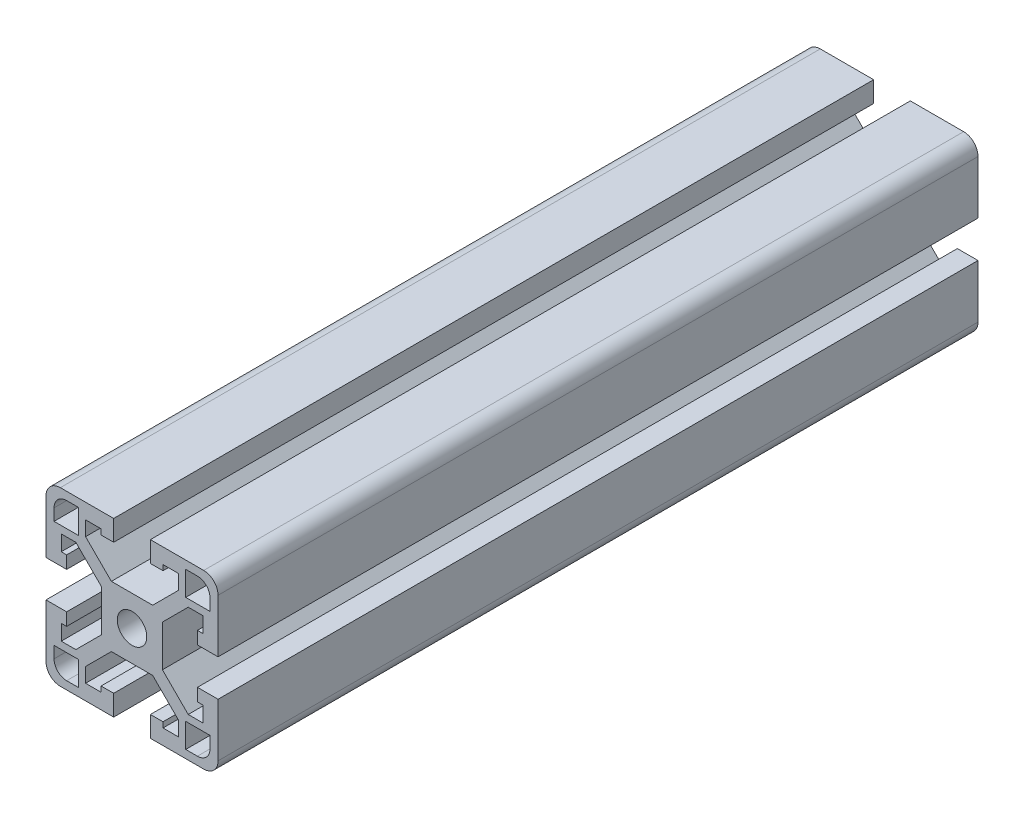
ISO-10303-21;
HEADER;
FILE_DESCRIPTION(('STEP AP214'),'2;1');
FILE_NAME('part.step','',(''),(''),'','','');
FILE_SCHEMA(('AUTOMOTIVE_DESIGN { 1 0 10303 214 1 1 1 1 }'));
ENDSEC;
DATA;
#1=APPLICATION_CONTEXT('core data for automotive mechanical design processes');
#2=APPLICATION_PROTOCOL_DEFINITION('international standard','automotive_design',2000,#1);
#3=PRODUCT_CONTEXT('',#1,'mechanical');
#4=PRODUCT('Part','Part','',(#3));
#5=PRODUCT_RELATED_PRODUCT_CATEGORY('part','',(#4));
#6=PRODUCT_DEFINITION_FORMATION('','',#4);
#7=PRODUCT_DEFINITION_CONTEXT('part definition',#1,'design');
#8=PRODUCT_DEFINITION('design','',#6,#7);
#9=PRODUCT_DEFINITION_SHAPE('','',#8);
#10=(LENGTH_UNIT() NAMED_UNIT(*) SI_UNIT(.MILLI.,.METRE.));
#11=(NAMED_UNIT(*) PLANE_ANGLE_UNIT() SI_UNIT($,.RADIAN.));
#12=(NAMED_UNIT(*) SI_UNIT($,.STERADIAN.) SOLID_ANGLE_UNIT());
#13=UNCERTAINTY_MEASURE_WITH_UNIT(LENGTH_MEASURE(1.E-05),#10,'distance_accuracy_value','');
#14=(GEOMETRIC_REPRESENTATION_CONTEXT(3) GLOBAL_UNCERTAINTY_ASSIGNED_CONTEXT((#13)) GLOBAL_UNIT_ASSIGNED_CONTEXT((#10,
#11,#12)) REPRESENTATION_CONTEXT('',''));
#15=CARTESIAN_POINT('',(0.,0.,0.));
#16=DIRECTION('',(0.,0.,1.));
#17=DIRECTION('',(1.,0.,0.));
#18=AXIS2_PLACEMENT_3D('',#15,#16,#17);
#19=CARTESIAN_POINT('',(-15.875,-15.875,84.1375));
#20=DIRECTION('',(0.,0.,1.));
#21=DIRECTION('',(1.,0.,0.));
#22=AXIS2_PLACEMENT_3D('',#19,#20,#21);
#23=PLANE('',#22);
#24=DIRECTION('',(0.707106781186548,-0.707106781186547,0.));
#25=VECTOR('',#24,1.);
#26=CARTESIAN_POINT('',(-12.4422614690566,10.287,84.1375));
#27=LINE('',#26,#25);
#28=CARTESIAN_POINT('',(-12.4422614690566,10.287,84.1375));
#29=VERTEX_POINT('',#28);
#30=CARTESIAN_POINT('',(-6.731,4.57573853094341,84.1375));
#31=VERTEX_POINT('',#30);
#32=EDGE_CURVE('E717',#29,#31,#27,.T.);
#33=ORIENTED_EDGE('',*,*,#32,.T.);
#34=DIRECTION('',(0.,-1.,0.));
#35=VECTOR('',#34,1.);
#36=CARTESIAN_POINT('',(-6.731,4.57573853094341,84.1375));
#37=LINE('',#36,#35);
#38=CARTESIAN_POINT('',(-6.731,-4.5757385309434,84.1375));
#39=VERTEX_POINT('',#38);
#40=EDGE_CURVE('E720',#31,#39,#37,.T.);
#41=ORIENTED_EDGE('',*,*,#40,.T.);
#42=DIRECTION('',(-0.707106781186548,-0.707106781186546,0.));
#43=VECTOR('',#42,1.);
#44=CARTESIAN_POINT('',(-6.731,-4.5757385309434,84.1375));
#45=LINE('',#44,#43);
#46=CARTESIAN_POINT('',(-12.4422614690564,-10.2869999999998,84.1375));
#47=VERTEX_POINT('',#46);
#48=EDGE_CURVE('E723',#39,#47,#45,.T.);
#49=ORIENTED_EDGE('',*,*,#48,.T.);
#50=DIRECTION('',(-1.,0.,0.));
#51=VECTOR('',#50,1.);
#52=CARTESIAN_POINT('',(-12.4422614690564,-10.2869999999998,84.1375));
#53=LINE('',#52,#51);
#54=CARTESIAN_POINT('',(-15.6718,-10.2869999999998,84.1375));
#55=VERTEX_POINT('',#54);
#56=EDGE_CURVE('E725',#47,#55,#53,.T.);
#57=ORIENTED_EDGE('',*,*,#56,.T.);
#58=DIRECTION('',(0.,1.,0.));
#59=VECTOR('',#58,1.);
#60=CARTESIAN_POINT('',(-15.6718,-10.2869999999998,84.1375));
#61=LINE('',#60,#59);
#62=CARTESIAN_POINT('',(-15.6718,-6.858,84.1375));
#63=VERTEX_POINT('',#62);
#64=EDGE_CURVE('E727',#55,#63,#61,.T.);
#65=ORIENTED_EDGE('',*,*,#64,.T.);
#66=DIRECTION('',(1.,0.,0.));
#67=VECTOR('',#66,1.);
#68=CARTESIAN_POINT('',(-15.6718,-6.858,84.1375));
#69=LINE('',#68,#67);
#70=CARTESIAN_POINT('',(-14.478,-6.85799999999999,84.1375));
#71=VERTEX_POINT('',#70);
#72=EDGE_CURVE('E729',#63,#71,#69,.T.);
#73=ORIENTED_EDGE('',*,*,#72,.T.);
#74=DIRECTION('',(0.,1.,0.));
#75=VECTOR('',#74,1.);
#76=CARTESIAN_POINT('',(-14.478,-6.85799999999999,84.1375));
#77=LINE('',#76,#75);
#78=CARTESIAN_POINT('',(-14.478,-4.064,84.1375));
#79=VERTEX_POINT('',#78);
#80=EDGE_CURVE('E731',#71,#79,#77,.T.);
#81=ORIENTED_EDGE('',*,*,#80,.T.);
#82=DIRECTION('',(-1.,0.,0.));
#83=VECTOR('',#82,1.);
#84=CARTESIAN_POINT('',(-14.478,-4.064,84.1375));
#85=LINE('',#84,#83);
#86=CARTESIAN_POINT('',(-19.05,-4.06400000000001,84.1375));
#87=VERTEX_POINT('',#86);
#88=EDGE_CURVE('E733',#79,#87,#85,.T.);
#89=ORIENTED_EDGE('',*,*,#88,.T.);
#90=DIRECTION('',(0.,-1.,0.));
#91=VECTOR('',#90,1.);
#92=CARTESIAN_POINT('',(-19.05,-4.06400000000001,84.1375));
#93=LINE('',#92,#91);
#94=CARTESIAN_POINT('',(-19.05,-15.875,84.1375));
#95=VERTEX_POINT('',#94);
#96=EDGE_CURVE('E735',#87,#95,#93,.T.);
#97=ORIENTED_EDGE('',*,*,#96,.T.);
#98=CARTESIAN_POINT('',(-15.875,-15.875,84.1375));
#99=DIRECTION('',(0.,0.,1.));
#100=DIRECTION('',(1.,0.,0.));
#101=AXIS2_PLACEMENT_3D('',#98,#99,#100);
#102=CIRCLE('',#101,3.17499999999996);
#103=CARTESIAN_POINT('',(-15.875,-19.05,84.1375));
#104=VERTEX_POINT('',#103);
#105=EDGE_CURVE('E737',#95,#104,#102,.T.);
#106=ORIENTED_EDGE('',*,*,#105,.T.);
#107=DIRECTION('',(1.,0.,0.));
#108=VECTOR('',#107,1.);
#109=CARTESIAN_POINT('',(-15.875,-19.05,84.1375));
#110=LINE('',#109,#108);
#111=CARTESIAN_POINT('',(-4.064,-19.05,84.1375));
#112=VERTEX_POINT('',#111);
#113=EDGE_CURVE('E739',#104,#112,#110,.T.);
#114=ORIENTED_EDGE('',*,*,#113,.T.);
#115=DIRECTION('',(0.,1.,0.));
#116=VECTOR('',#115,1.);
#117=CARTESIAN_POINT('',(-4.064,-19.05,84.1375));
#118=LINE('',#117,#116);
#119=CARTESIAN_POINT('',(-4.064,-14.478,84.1375));
#120=VERTEX_POINT('',#119);
#121=EDGE_CURVE('E741',#112,#120,#118,.T.);
#122=ORIENTED_EDGE('',*,*,#121,.T.);
#123=DIRECTION('',(-1.,0.,0.));
#124=VECTOR('',#123,1.);
#125=CARTESIAN_POINT('',(-4.064,-14.478,84.1375));
#126=LINE('',#125,#124);
#127=CARTESIAN_POINT('',(-6.85799999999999,-14.478,84.1375));
#128=VERTEX_POINT('',#127);
#129=EDGE_CURVE('E743',#120,#128,#126,.T.);
#130=ORIENTED_EDGE('',*,*,#129,.T.);
#131=DIRECTION('',(0.,-1.,0.));
#132=VECTOR('',#131,1.);
#133=CARTESIAN_POINT('',(-6.85799999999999,-14.478,84.1375));
#134=LINE('',#133,#132);
#135=CARTESIAN_POINT('',(-6.85799999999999,-15.6718,84.1375));
#136=VERTEX_POINT('',#135);
#137=EDGE_CURVE('E745',#128,#136,#134,.T.);
#138=ORIENTED_EDGE('',*,*,#137,.T.);
#139=DIRECTION('',(-1.,0.,0.));
#140=VECTOR('',#139,1.);
#141=CARTESIAN_POINT('',(-6.85799999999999,-15.6718,84.1375));
#142=LINE('',#141,#140);
#143=CARTESIAN_POINT('',(-10.2869999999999,-15.6718,84.1375));
#144=VERTEX_POINT('',#143);
#145=EDGE_CURVE('E747',#136,#144,#142,.T.);
#146=ORIENTED_EDGE('',*,*,#145,.T.);
#147=DIRECTION('',(0.,1.,0.));
#148=VECTOR('',#147,1.);
#149=CARTESIAN_POINT('',(-10.2869999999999,-15.6718,84.1375));
#150=LINE('',#149,#148);
#151=CARTESIAN_POINT('',(-10.2869999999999,-12.4422614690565,84.1375));
#152=VERTEX_POINT('',#151);
#153=EDGE_CURVE('E749',#144,#152,#150,.T.);
#154=ORIENTED_EDGE('',*,*,#153,.T.);
#155=DIRECTION('',(0.707106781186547,0.707106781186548,0.));
#156=VECTOR('',#155,1.);
#157=CARTESIAN_POINT('',(-10.2869999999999,-12.4422614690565,84.1375));
#158=LINE('',#157,#156);
#159=CARTESIAN_POINT('',(-4.57573853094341,-6.73100000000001,84.1375));
#160=VERTEX_POINT('',#159);
#161=EDGE_CURVE('E751',#152,#160,#158,.T.);
#162=ORIENTED_EDGE('',*,*,#161,.T.);
#163=DIRECTION('',(1.,0.,0.));
#164=VECTOR('',#163,1.);
#165=CARTESIAN_POINT('',(-4.57573853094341,-6.73100000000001,84.1375));
#166=LINE('',#165,#164);
#167=CARTESIAN_POINT('',(4.57573853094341,-6.73100000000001,84.1375));
#168=VERTEX_POINT('',#167);
#169=EDGE_CURVE('E753',#160,#168,#166,.T.);
#170=ORIENTED_EDGE('',*,*,#169,.T.);
#171=DIRECTION('',(0.707106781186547,-0.707106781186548,0.));
#172=VECTOR('',#171,1.);
#173=CARTESIAN_POINT('',(4.57573853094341,-6.73100000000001,84.1375));
#174=LINE('',#173,#172);
#175=CARTESIAN_POINT('',(10.2869999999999,-12.4422614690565,84.1375));
#176=VERTEX_POINT('',#175);
#177=EDGE_CURVE('E755',#168,#176,#174,.T.);
#178=ORIENTED_EDGE('',*,*,#177,.T.);
#179=DIRECTION('',(0.,-1.,0.));
#180=VECTOR('',#179,1.);
#181=CARTESIAN_POINT('',(10.2869999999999,-12.4422614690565,84.1375));
#182=LINE('',#181,#180);
#183=CARTESIAN_POINT('',(10.2869999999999,-15.6718,84.1375));
#184=VERTEX_POINT('',#183);
#185=EDGE_CURVE('E757',#176,#184,#182,.T.);
#186=ORIENTED_EDGE('',*,*,#185,.T.);
#187=DIRECTION('',(-1.,0.,0.));
#188=VECTOR('',#187,1.);
#189=CARTESIAN_POINT('',(10.2869999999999,-15.6718,84.1375));
#190=LINE('',#189,#188);
#191=CARTESIAN_POINT('',(6.85800000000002,-15.6718,84.1375));
#192=VERTEX_POINT('',#191);
#193=EDGE_CURVE('E759',#184,#192,#190,.T.);
#194=ORIENTED_EDGE('',*,*,#193,.T.);
#195=DIRECTION('',(0.,1.,0.));
#196=VECTOR('',#195,1.);
#197=CARTESIAN_POINT('',(6.85800000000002,-15.6718,84.1375));
#198=LINE('',#197,#196);
#199=CARTESIAN_POINT('',(6.85800000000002,-14.478,84.1375));
#200=VERTEX_POINT('',#199);
#201=EDGE_CURVE('E761',#192,#200,#198,.T.);
#202=ORIENTED_EDGE('',*,*,#201,.T.);
#203=DIRECTION('',(-1.,0.,0.));
#204=VECTOR('',#203,1.);
#205=CARTESIAN_POINT('',(6.85800000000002,-14.478,84.1375));
#206=LINE('',#205,#204);
#207=CARTESIAN_POINT('',(4.06400000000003,-14.478,84.1375));
#208=VERTEX_POINT('',#207);
#209=EDGE_CURVE('E763',#200,#208,#206,.T.);
#210=ORIENTED_EDGE('',*,*,#209,.T.);
#211=DIRECTION('',(0.,-1.,0.));
#212=VECTOR('',#211,1.);
#213=CARTESIAN_POINT('',(4.06400000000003,-14.478,84.1375));
#214=LINE('',#213,#212);
#215=CARTESIAN_POINT('',(4.06400000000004,-19.05,84.1375));
#216=VERTEX_POINT('',#215);
#217=EDGE_CURVE('E765',#208,#216,#214,.T.);
#218=ORIENTED_EDGE('',*,*,#217,.T.);
#219=DIRECTION('',(1.,0.,0.));
#220=VECTOR('',#219,1.);
#221=CARTESIAN_POINT('',(4.06400000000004,-19.05,84.1375));
#222=LINE('',#221,#220);
#223=CARTESIAN_POINT('',(15.8750000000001,-19.05,84.1375));
#224=VERTEX_POINT('',#223);
#225=EDGE_CURVE('E767',#216,#224,#222,.T.);
#226=ORIENTED_EDGE('',*,*,#225,.T.);
#227=CARTESIAN_POINT('',(15.8750000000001,-15.875,84.1375));
#228=DIRECTION('',(0.,0.,1.));
#229=DIRECTION('',(1.,0.,0.));
#230=AXIS2_PLACEMENT_3D('',#227,#228,#229);
#231=CIRCLE('',#230,3.17499999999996);
#232=CARTESIAN_POINT('',(19.05,-15.875,84.1375));
#233=VERTEX_POINT('',#232);
#234=EDGE_CURVE('E769',#224,#233,#231,.T.);
#235=ORIENTED_EDGE('',*,*,#234,.T.);
#236=DIRECTION('',(0.,1.,0.));
#237=VECTOR('',#236,1.);
#238=CARTESIAN_POINT('',(19.05,-15.875,84.1375));
#239=LINE('',#238,#237);
#240=CARTESIAN_POINT('',(19.05,-4.064,84.1375));
#241=VERTEX_POINT('',#240);
#242=EDGE_CURVE('E771',#233,#241,#239,.T.);
#243=ORIENTED_EDGE('',*,*,#242,.T.);
#244=DIRECTION('',(-1.,0.,0.));
#245=VECTOR('',#244,1.);
#246=CARTESIAN_POINT('',(19.05,-4.064,84.1375));
#247=LINE('',#246,#245);
#248=CARTESIAN_POINT('',(14.478,-4.064,84.1375));
#249=VERTEX_POINT('',#248);
#250=EDGE_CURVE('E773',#241,#249,#247,.T.);
#251=ORIENTED_EDGE('',*,*,#250,.T.);
#252=DIRECTION('',(0.,-1.,0.));
#253=VECTOR('',#252,1.);
#254=CARTESIAN_POINT('',(14.478,-4.064,84.1375));
#255=LINE('',#254,#253);
#256=CARTESIAN_POINT('',(14.478,-6.85799999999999,84.1375));
#257=VERTEX_POINT('',#256);
#258=EDGE_CURVE('E775',#249,#257,#255,.T.);
#259=ORIENTED_EDGE('',*,*,#258,.T.);
#260=DIRECTION('',(1.,0.,0.));
#261=VECTOR('',#260,1.);
#262=CARTESIAN_POINT('',(14.478,-6.85799999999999,84.1375));
#263=LINE('',#262,#261);
#264=CARTESIAN_POINT('',(15.6718,-6.85799999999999,84.1375));
#265=VERTEX_POINT('',#264);
#266=EDGE_CURVE('E777',#257,#265,#263,.T.);
#267=ORIENTED_EDGE('',*,*,#266,.T.);
#268=DIRECTION('',(0.,-1.,0.));
#269=VECTOR('',#268,1.);
#270=CARTESIAN_POINT('',(15.6718,-6.85799999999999,84.1375));
#271=LINE('',#270,#269);
#272=CARTESIAN_POINT('',(15.6718,-10.2869999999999,84.1375));
#273=VERTEX_POINT('',#272);
#274=EDGE_CURVE('E779',#265,#273,#271,.T.);
#275=ORIENTED_EDGE('',*,*,#274,.T.);
#276=DIRECTION('',(-1.,0.,0.));
#277=VECTOR('',#276,1.);
#278=CARTESIAN_POINT('',(15.6718,-10.2869999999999,84.1375));
#279=LINE('',#278,#277);
#280=CARTESIAN_POINT('',(12.4422614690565,-10.2869999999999,84.1375));
#281=VERTEX_POINT('',#280);
#282=EDGE_CURVE('E781',#273,#281,#279,.T.);
#283=ORIENTED_EDGE('',*,*,#282,.T.);
#284=DIRECTION('',(-0.707106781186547,0.707106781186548,0.));
#285=VECTOR('',#284,1.);
#286=CARTESIAN_POINT('',(12.4422614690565,-10.2869999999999,84.1375));
#287=LINE('',#286,#285);
#288=CARTESIAN_POINT('',(6.73100000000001,-4.57573853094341,84.1375));
#289=VERTEX_POINT('',#288);
#290=EDGE_CURVE('E783',#281,#289,#287,.T.);
#291=ORIENTED_EDGE('',*,*,#290,.T.);
#292=DIRECTION('',(0.,1.,0.));
#293=VECTOR('',#292,1.);
#294=CARTESIAN_POINT('',(6.73100000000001,-4.57573853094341,84.1375));
#295=LINE('',#294,#293);
#296=CARTESIAN_POINT('',(6.73100000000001,4.5757385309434,84.1375));
#297=VERTEX_POINT('',#296);
#298=EDGE_CURVE('E785',#289,#297,#295,.T.);
#299=ORIENTED_EDGE('',*,*,#298,.T.);
#300=DIRECTION('',(0.707106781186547,0.707106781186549,0.));
#301=VECTOR('',#300,1.);
#302=CARTESIAN_POINT('',(6.73100000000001,4.5757385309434,84.1375));
#303=LINE('',#302,#301);
#304=CARTESIAN_POINT('',(12.4422614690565,10.2869999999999,84.1375));
#305=VERTEX_POINT('',#304);
#306=EDGE_CURVE('E787',#297,#305,#303,.T.);
#307=ORIENTED_EDGE('',*,*,#306,.T.);
#308=DIRECTION('',(1.,0.,0.));
#309=VECTOR('',#308,1.);
#310=CARTESIAN_POINT('',(12.4422614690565,10.2869999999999,84.1375));
#311=LINE('',#310,#309);
#312=CARTESIAN_POINT('',(15.6718,10.2870000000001,84.1375));
#313=VERTEX_POINT('',#312);
#314=EDGE_CURVE('E789',#305,#313,#311,.T.);
#315=ORIENTED_EDGE('',*,*,#314,.T.);
#316=DIRECTION('',(0.,-1.,0.));
#317=VECTOR('',#316,1.);
#318=CARTESIAN_POINT('',(15.6718,10.2870000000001,84.1375));
#319=LINE('',#318,#317);
#320=CARTESIAN_POINT('',(15.6718,6.858,84.1375));
#321=VERTEX_POINT('',#320);
#322=EDGE_CURVE('E791',#313,#321,#319,.T.);
#323=ORIENTED_EDGE('',*,*,#322,.T.);
#324=DIRECTION('',(-1.,-1.48217284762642E-13,0.));
#325=VECTOR('',#324,1.);
#326=CARTESIAN_POINT('',(15.6718,6.858,84.1375));
#327=LINE('',#326,#325);
#328=CARTESIAN_POINT('',(14.4780000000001,6.85799999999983,84.1375));
#329=VERTEX_POINT('',#328);
#330=EDGE_CURVE('E793',#321,#329,#327,.T.);
#331=ORIENTED_EDGE('',*,*,#330,.T.);
#332=DIRECTION('',(0.,-1.,0.));
#333=VECTOR('',#332,1.);
#334=CARTESIAN_POINT('',(14.4780000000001,6.85799999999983,84.1375));
#335=LINE('',#334,#333);
#336=CARTESIAN_POINT('',(14.4780000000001,4.06399999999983,84.1375));
#337=VERTEX_POINT('',#336);
#338=EDGE_CURVE('E795',#329,#337,#335,.T.);
#339=ORIENTED_EDGE('',*,*,#338,.T.);
#340=DIRECTION('',(1.,0.,0.));
#341=VECTOR('',#340,1.);
#342=CARTESIAN_POINT('',(14.4780000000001,4.06399999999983,84.1375));
#343=LINE('',#342,#341);
#344=CARTESIAN_POINT('',(19.05,4.06399999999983,84.1375));
#345=VERTEX_POINT('',#344);
#346=EDGE_CURVE('E797',#337,#345,#343,.T.);
#347=ORIENTED_EDGE('',*,*,#346,.T.);
#348=DIRECTION('',(0.,1.,0.));
#349=VECTOR('',#348,1.);
#350=CARTESIAN_POINT('',(19.05,4.06399999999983,84.1375));
#351=LINE('',#350,#349);
#352=CARTESIAN_POINT('',(19.05,15.8750000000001,84.1375));
#353=VERTEX_POINT('',#352);
#354=EDGE_CURVE('E799',#345,#353,#351,.T.);
#355=ORIENTED_EDGE('',*,*,#354,.T.);
#356=CARTESIAN_POINT('',(15.8750000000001,15.8750000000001,84.1375));
#357=DIRECTION('',(0.,0.,1.));
#358=DIRECTION('',(1.,0.,0.));
#359=AXIS2_PLACEMENT_3D('',#356,#357,#358);
#360=CIRCLE('',#359,3.17499999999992);
#361=CARTESIAN_POINT('',(15.875,19.05,84.1375));
#362=VERTEX_POINT('',#361);
#363=EDGE_CURVE('E801',#353,#362,#360,.T.);
#364=ORIENTED_EDGE('',*,*,#363,.T.);
#365=DIRECTION('',(-1.,0.,0.));
#366=VECTOR('',#365,1.);
#367=CARTESIAN_POINT('',(15.875,19.05,84.1375));
#368=LINE('',#367,#366);
#369=CARTESIAN_POINT('',(4.06399999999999,19.05,84.1375));
#370=VERTEX_POINT('',#369);
#371=EDGE_CURVE('E803',#362,#370,#368,.T.);
#372=ORIENTED_EDGE('',*,*,#371,.T.);
#373=DIRECTION('',(0.,-1.,0.));
#374=VECTOR('',#373,1.);
#375=CARTESIAN_POINT('',(4.06399999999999,19.05,84.1375));
#376=LINE('',#375,#374);
#377=CARTESIAN_POINT('',(4.06399999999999,14.478,84.1375));
#378=VERTEX_POINT('',#377);
#379=EDGE_CURVE('E805',#370,#378,#376,.T.);
#380=ORIENTED_EDGE('',*,*,#379,.T.);
#381=DIRECTION('',(1.,0.,0.));
#382=VECTOR('',#381,1.);
#383=CARTESIAN_POINT('',(4.06399999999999,14.478,84.1375));
#384=LINE('',#383,#382);
#385=CARTESIAN_POINT('',(6.85799999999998,14.478,84.1375));
#386=VERTEX_POINT('',#385);
#387=EDGE_CURVE('E807',#378,#386,#384,.T.);
#388=ORIENTED_EDGE('',*,*,#387,.T.);
#389=DIRECTION('',(0.,1.,0.));
#390=VECTOR('',#389,1.);
#391=CARTESIAN_POINT('',(6.85799999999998,14.478,84.1375));
#392=LINE('',#391,#390);
#393=CARTESIAN_POINT('',(6.85799999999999,15.6718000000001,84.1375));
#394=VERTEX_POINT('',#393);
#395=EDGE_CURVE('E809',#386,#394,#392,.T.);
#396=ORIENTED_EDGE('',*,*,#395,.T.);
#397=DIRECTION('',(1.,0.,0.));
#398=VECTOR('',#397,1.);
#399=CARTESIAN_POINT('',(6.85799999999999,15.6718000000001,84.1375));
#400=LINE('',#399,#398);
#401=CARTESIAN_POINT('',(10.2869999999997,15.6718000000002,84.1375));
#402=VERTEX_POINT('',#401);
#403=EDGE_CURVE('E811',#394,#402,#400,.T.);
#404=ORIENTED_EDGE('',*,*,#403,.T.);
#405=DIRECTION('',(0.,-1.,0.));
#406=VECTOR('',#405,1.);
#407=CARTESIAN_POINT('',(10.2869999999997,15.6718000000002,84.1375));
#408=LINE('',#407,#406);
#409=CARTESIAN_POINT('',(10.2869999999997,12.4422614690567,84.1375));
#410=VERTEX_POINT('',#409);
#411=EDGE_CURVE('E813',#402,#410,#408,.T.);
#412=ORIENTED_EDGE('',*,*,#411,.T.);
#413=DIRECTION('',(-0.707106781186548,-0.707106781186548,0.));
#414=VECTOR('',#413,1.);
#415=CARTESIAN_POINT('',(10.2869999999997,12.4422614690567,84.1375));
#416=LINE('',#415,#414);
#417=CARTESIAN_POINT('',(4.57573853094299,6.73100000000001,84.1375));
#418=VERTEX_POINT('',#417);
#419=EDGE_CURVE('E815',#410,#418,#416,.T.);
#420=ORIENTED_EDGE('',*,*,#419,.T.);
#421=DIRECTION('',(-1.,0.,0.));
#422=VECTOR('',#421,1.);
#423=CARTESIAN_POINT('',(4.57573853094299,6.73100000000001,84.1375));
#424=LINE('',#423,#422);
#425=CARTESIAN_POINT('',(-4.57573853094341,6.73100000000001,84.1375));
#426=VERTEX_POINT('',#425);
#427=EDGE_CURVE('E817',#418,#426,#424,.T.);
#428=ORIENTED_EDGE('',*,*,#427,.T.);
#429=DIRECTION('',(-0.707106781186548,0.707106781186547,0.));
#430=VECTOR('',#429,1.);
#431=CARTESIAN_POINT('',(-4.57573853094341,6.73100000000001,84.1375));
#432=LINE('',#431,#430);
#433=CARTESIAN_POINT('',(-10.287,12.4422614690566,84.1375));
#434=VERTEX_POINT('',#433);
#435=EDGE_CURVE('E819',#426,#434,#432,.T.);
#436=ORIENTED_EDGE('',*,*,#435,.T.);
#437=DIRECTION('',(0.,1.,0.));
#438=VECTOR('',#437,1.);
#439=CARTESIAN_POINT('',(-10.287,12.4422614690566,84.1375));
#440=LINE('',#439,#438);
#441=CARTESIAN_POINT('',(-10.287,15.6718,84.1375));
#442=VERTEX_POINT('',#441);
#443=EDGE_CURVE('E821',#434,#442,#440,.T.);
#444=ORIENTED_EDGE('',*,*,#443,.T.);
#445=DIRECTION('',(1.,0.,0.));
#446=VECTOR('',#445,1.);
#447=CARTESIAN_POINT('',(-10.287,15.6718,84.1375));
#448=LINE('',#447,#446);
#449=CARTESIAN_POINT('',(-6.858,15.6718,84.1375));
#450=VERTEX_POINT('',#449);
#451=EDGE_CURVE('E823',#442,#450,#448,.T.);
#452=ORIENTED_EDGE('',*,*,#451,.T.);
#453=DIRECTION('',(0.,-1.,0.));
#454=VECTOR('',#453,1.);
#455=CARTESIAN_POINT('',(-6.858,15.6718,84.1375));
#456=LINE('',#455,#454);
#457=CARTESIAN_POINT('',(-6.858,14.478,84.1375));
#458=VERTEX_POINT('',#457);
#459=EDGE_CURVE('E825',#450,#458,#456,.T.);
#460=ORIENTED_EDGE('',*,*,#459,.T.);
#461=DIRECTION('',(1.,0.,0.));
#462=VECTOR('',#461,1.);
#463=CARTESIAN_POINT('',(-6.858,14.478,84.1375));
#464=LINE('',#463,#462);
#465=CARTESIAN_POINT('',(-4.064,14.478,84.1375));
#466=VERTEX_POINT('',#465);
#467=EDGE_CURVE('E827',#458,#466,#464,.T.);
#468=ORIENTED_EDGE('',*,*,#467,.T.);
#469=DIRECTION('',(0.,1.,0.));
#470=VECTOR('',#469,1.);
#471=CARTESIAN_POINT('',(-4.064,14.478,84.1375));
#472=LINE('',#471,#470);
#473=CARTESIAN_POINT('',(-4.06400000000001,19.05,84.1375));
#474=VERTEX_POINT('',#473);
#475=EDGE_CURVE('E829',#466,#474,#472,.T.);
#476=ORIENTED_EDGE('',*,*,#475,.T.);
#477=DIRECTION('',(-1.,0.,0.));
#478=VECTOR('',#477,1.);
#479=CARTESIAN_POINT('',(-4.06400000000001,19.05,84.1375));
#480=LINE('',#479,#478);
#481=CARTESIAN_POINT('',(-15.875,19.05,84.1375));
#482=VERTEX_POINT('',#481);
#483=EDGE_CURVE('E831',#474,#482,#480,.T.);
#484=ORIENTED_EDGE('',*,*,#483,.T.);
#485=CARTESIAN_POINT('',(-15.875,15.875,84.1375));
#486=DIRECTION('',(0.,0.,1.));
#487=DIRECTION('',(1.,0.,0.));
#488=AXIS2_PLACEMENT_3D('',#485,#486,#487);
#489=CIRCLE('',#488,3.17499999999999);
#490=CARTESIAN_POINT('',(-19.05,15.875,84.1375));
#491=VERTEX_POINT('',#490);
#492=EDGE_CURVE('E833',#482,#491,#489,.T.);
#493=ORIENTED_EDGE('',*,*,#492,.T.);
#494=DIRECTION('',(0.,-1.,0.));
#495=VECTOR('',#494,1.);
#496=CARTESIAN_POINT('',(-19.05,15.875,84.1375));
#497=LINE('',#496,#495);
#498=CARTESIAN_POINT('',(-19.05,4.06400000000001,84.1375));
#499=VERTEX_POINT('',#498);
#500=EDGE_CURVE('E835',#491,#499,#497,.T.);
#501=ORIENTED_EDGE('',*,*,#500,.T.);
#502=DIRECTION('',(1.,0.,0.));
#503=VECTOR('',#502,1.);
#504=CARTESIAN_POINT('',(-19.05,4.06400000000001,84.1375));
#505=LINE('',#504,#503);
#506=CARTESIAN_POINT('',(-14.478,4.06400000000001,84.1375));
#507=VERTEX_POINT('',#506);
#508=EDGE_CURVE('E837',#499,#507,#505,.T.);
#509=ORIENTED_EDGE('',*,*,#508,.T.);
#510=DIRECTION('',(0.,1.,0.));
#511=VECTOR('',#510,1.);
#512=CARTESIAN_POINT('',(-14.478,4.06400000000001,84.1375));
#513=LINE('',#512,#511);
#514=CARTESIAN_POINT('',(-14.478,6.85800000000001,84.1375));
#515=VERTEX_POINT('',#514);
#516=EDGE_CURVE('E839',#507,#515,#513,.T.);
#517=ORIENTED_EDGE('',*,*,#516,.T.);
#518=DIRECTION('',(-1.,0.,0.));
#519=VECTOR('',#518,1.);
#520=CARTESIAN_POINT('',(-14.478,6.85800000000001,84.1375));
#521=LINE('',#520,#519);
#522=CARTESIAN_POINT('',(-15.6718,6.85800000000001,84.1375));
#523=VERTEX_POINT('',#522);
#524=EDGE_CURVE('E841',#515,#523,#521,.T.);
#525=ORIENTED_EDGE('',*,*,#524,.T.);
#526=DIRECTION('',(0.,1.,0.));
#527=VECTOR('',#526,1.);
#528=CARTESIAN_POINT('',(-15.6718,6.85800000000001,84.1375));
#529=LINE('',#528,#527);
#530=CARTESIAN_POINT('',(-15.6718,10.2870000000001,84.1375));
#531=VERTEX_POINT('',#530);
#532=EDGE_CURVE('E843',#523,#531,#529,.T.);
#533=ORIENTED_EDGE('',*,*,#532,.T.);
#534=DIRECTION('',(1.,0.,0.));
#535=VECTOR('',#534,1.);
#536=CARTESIAN_POINT('',(-15.6718,10.2870000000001,84.1375));
#537=LINE('',#536,#535);
#538=EDGE_CURVE('E845',#531,#29,#537,.T.);
#539=ORIENTED_EDGE('',*,*,#538,.T.);
#540=EDGE_LOOP('',(#33,#41,#49,#57,#65,#73,#81,#89,#97,#106,#114,#122,#130,#138,#146,#154,#162,
#170,#178,#186,#194,#202,#210,#218,#226,#235,#243,#251,#259,#267,#275,#283,#291,#299,#307,#315,
#323,#331,#339,#347,#355,#364,#372,#380,#388,#396,#404,#412,#420,#428,#436,#444,#452,#460,#468,
#476,#484,#493,#501,#509,#517,#525,#533,#539));
#541=FACE_BOUND('',#540,.T.);
#542=CARTESIAN_POINT('',(0.,0.,84.1375));
#543=DIRECTION('',(0.,0.,1.));
#544=DIRECTION('',(1.,0.,0.));
#545=AXIS2_PLACEMENT_3D('',#542,#543,#544);
#546=CIRCLE('',#545,3.26390000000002);
#547=CARTESIAN_POINT('',(-3.26390000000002,0.,84.1375));
#548=VERTEX_POINT('',#547);
#549=EDGE_CURVE('E711',#548,#548,#546,.T.);
#550=ORIENTED_EDGE('',*,*,#549,.F.);
#551=EDGE_LOOP('',(#550));
#552=FACE_BOUND('',#551,.T.);
#553=DIRECTION('',(0.,-1.,0.));
#554=VECTOR('',#553,1.);
#555=CARTESIAN_POINT('',(-17.272,14.478,84.1375));
#556=LINE('',#555,#554);
#557=CARTESIAN_POINT('',(-17.272,14.478,84.1375));
#558=VERTEX_POINT('',#557);
#559=CARTESIAN_POINT('',(-17.272,11.8872,84.1375));
#560=VERTEX_POINT('',#559);
#561=EDGE_CURVE('E675',#558,#560,#556,.T.);
#562=ORIENTED_EDGE('',*,*,#561,.F.);
#563=CARTESIAN_POINT('',(-14.478,14.478,84.1375));
#564=DIRECTION('',(0.,0.,1.));
#565=DIRECTION('',(1.,0.,0.));
#566=AXIS2_PLACEMENT_3D('',#563,#564,#565);
#567=CIRCLE('',#566,2.794);
#568=CARTESIAN_POINT('',(-14.478,17.272,84.1375));
#569=VERTEX_POINT('',#568);
#570=EDGE_CURVE('E673',#569,#558,#567,.T.);
#571=ORIENTED_EDGE('',*,*,#570,.F.);
#572=DIRECTION('',(-1.,0.,0.));
#573=VECTOR('',#572,1.);
#574=CARTESIAN_POINT('',(-11.8872,17.272,84.1375));
#575=LINE('',#574,#573);
#576=CARTESIAN_POINT('',(-11.8872,17.272,84.1375));
#577=VERTEX_POINT('',#576);
#578=EDGE_CURVE('E683',#577,#569,#575,.T.);
#579=ORIENTED_EDGE('',*,*,#578,.F.);
#580=DIRECTION('',(0.,1.,0.));
#581=VECTOR('',#580,1.);
#582=CARTESIAN_POINT('',(-11.8872,11.8872,84.1375));
#583=LINE('',#582,#581);
#584=CARTESIAN_POINT('',(-11.8872,11.8872,84.1375));
#585=VERTEX_POINT('',#584);
#586=EDGE_CURVE('E680',#585,#577,#583,.T.);
#587=ORIENTED_EDGE('',*,*,#586,.F.);
#588=DIRECTION('',(1.,0.,0.));
#589=VECTOR('',#588,1.);
#590=CARTESIAN_POINT('',(-17.272,11.8872,84.1375));
#591=LINE('',#590,#589);
#592=EDGE_CURVE('E678',#560,#585,#591,.T.);
#593=ORIENTED_EDGE('',*,*,#592,.F.);
#594=EDGE_LOOP('',(#562,#571,#579,#587,#593));
#595=FACE_BOUND('',#594,.T.);
#596=DIRECTION('',(1.,0.,0.));
#597=VECTOR('',#596,1.);
#598=CARTESIAN_POINT('',(11.8872,11.8872,84.1375));
#599=LINE('',#598,#597);
#600=CARTESIAN_POINT('',(11.8872,11.8872,84.1375));
#601=VERTEX_POINT('',#600);
#602=CARTESIAN_POINT('',(17.272,11.8872,84.1375));
#603=VERTEX_POINT('',#602);
#604=EDGE_CURVE('E637',#601,#603,#599,.T.);
#605=ORIENTED_EDGE('',*,*,#604,.F.);
#606=DIRECTION('',(0.,-1.,0.));
#607=VECTOR('',#606,1.);
#608=CARTESIAN_POINT('',(11.8872,17.272,84.1375));
#609=LINE('',#608,#607);
#610=CARTESIAN_POINT('',(11.8872,17.272,84.1375));
#611=VERTEX_POINT('',#610);
#612=EDGE_CURVE('E635',#611,#601,#609,.T.);
#613=ORIENTED_EDGE('',*,*,#612,.F.);
#614=DIRECTION('',(-1.,0.,0.));
#615=VECTOR('',#614,1.);
#616=CARTESIAN_POINT('',(14.478,17.272,84.1375));
#617=LINE('',#616,#615);
#618=CARTESIAN_POINT('',(14.478,17.272,84.1375));
#619=VERTEX_POINT('',#618);
#620=EDGE_CURVE('E645',#619,#611,#617,.T.);
#621=ORIENTED_EDGE('',*,*,#620,.F.);
#622=CARTESIAN_POINT('',(14.478,14.478,84.1375));
#623=DIRECTION('',(0.,0.,1.));
#624=DIRECTION('',(1.,0.,0.));
#625=AXIS2_PLACEMENT_3D('',#622,#623,#624);
#626=CIRCLE('',#625,2.794);
#627=CARTESIAN_POINT('',(17.272,14.478,84.1375));
#628=VERTEX_POINT('',#627);
#629=EDGE_CURVE('E642',#628,#619,#626,.T.);
#630=ORIENTED_EDGE('',*,*,#629,.F.);
#631=DIRECTION('',(0.,1.,0.));
#632=VECTOR('',#631,1.);
#633=CARTESIAN_POINT('',(17.272,11.8872,84.1375));
#634=LINE('',#633,#632);
#635=EDGE_CURVE('E640',#603,#628,#634,.T.);
#636=ORIENTED_EDGE('',*,*,#635,.F.);
#637=EDGE_LOOP('',(#605,#613,#621,#630,#636));
#638=FACE_BOUND('',#637,.T.);
#639=DIRECTION('',(0.,1.,0.));
#640=VECTOR('',#639,1.);
#641=CARTESIAN_POINT('',(17.272,-14.478,84.1375));
#642=LINE('',#641,#640);
#643=CARTESIAN_POINT('',(17.272,-14.478,84.1375));
#644=VERTEX_POINT('',#643);
#645=CARTESIAN_POINT('',(17.272,-11.8872,84.1375));
#646=VERTEX_POINT('',#645);
#647=EDGE_CURVE('E599',#644,#646,#642,.T.);
#648=ORIENTED_EDGE('',*,*,#647,.F.);
#649=CARTESIAN_POINT('',(14.478,-14.478,84.1375));
#650=DIRECTION('',(0.,0.,1.));
#651=DIRECTION('',(1.,0.,0.));
#652=AXIS2_PLACEMENT_3D('',#649,#650,#651);
#653=CIRCLE('',#652,2.794);
#654=CARTESIAN_POINT('',(14.478,-17.272,84.1375));
#655=VERTEX_POINT('',#654);
#656=EDGE_CURVE('E597',#655,#644,#653,.T.);
#657=ORIENTED_EDGE('',*,*,#656,.F.);
#658=DIRECTION('',(1.,0.,0.));
#659=VECTOR('',#658,1.);
#660=CARTESIAN_POINT('',(11.8872,-17.272,84.1375));
#661=LINE('',#660,#659);
#662=CARTESIAN_POINT('',(11.8872,-17.272,84.1375));
#663=VERTEX_POINT('',#662);
#664=EDGE_CURVE('E607',#663,#655,#661,.T.);
#665=ORIENTED_EDGE('',*,*,#664,.F.);
#666=DIRECTION('',(0.,-1.,0.));
#667=VECTOR('',#666,1.);
#668=CARTESIAN_POINT('',(11.8872,-11.8872,84.1375));
#669=LINE('',#668,#667);
#670=CARTESIAN_POINT('',(11.8872,-11.8872,84.1375));
#671=VERTEX_POINT('',#670);
#672=EDGE_CURVE('E604',#671,#663,#669,.T.);
#673=ORIENTED_EDGE('',*,*,#672,.F.);
#674=DIRECTION('',(-1.,0.,0.));
#675=VECTOR('',#674,1.);
#676=CARTESIAN_POINT('',(17.272,-11.8872,84.1375));
#677=LINE('',#676,#675);
#678=EDGE_CURVE('E602',#646,#671,#677,.T.);
#679=ORIENTED_EDGE('',*,*,#678,.F.);
#680=EDGE_LOOP('',(#648,#657,#665,#673,#679));
#681=FACE_BOUND('',#680,.T.);
#682=DIRECTION('',(-1.,0.,0.));
#683=VECTOR('',#682,1.);
#684=CARTESIAN_POINT('',(-11.8872,-11.8872,84.1375));
#685=LINE('',#684,#683);
#686=CARTESIAN_POINT('',(-11.8872,-11.8872,84.1375));
#687=VERTEX_POINT('',#686);
#688=CARTESIAN_POINT('',(-17.272,-11.8872,84.1375));
#689=VERTEX_POINT('',#688);
#690=EDGE_CURVE('E561',#687,#689,#685,.T.);
#691=ORIENTED_EDGE('',*,*,#690,.F.);
#692=DIRECTION('',(0.,1.,0.));
#693=VECTOR('',#692,1.);
#694=CARTESIAN_POINT('',(-11.8872,-17.272,84.1375));
#695=LINE('',#694,#693);
#696=CARTESIAN_POINT('',(-11.8872,-17.272,84.1375));
#697=VERTEX_POINT('',#696);
#698=EDGE_CURVE('E553',#697,#687,#695,.T.);
#699=ORIENTED_EDGE('',*,*,#698,.F.);
#700=DIRECTION('',(1.,0.,0.));
#701=VECTOR('',#700,1.);
#702=CARTESIAN_POINT('',(-14.478,-17.272,84.1375));
#703=LINE('',#702,#701);
#704=CARTESIAN_POINT('',(-14.478,-17.272,84.1375));
#705=VERTEX_POINT('',#704);
#706=EDGE_CURVE('E580',#705,#697,#703,.T.);
#707=ORIENTED_EDGE('',*,*,#706,.F.);
#708=CARTESIAN_POINT('',(-14.478,-14.478,84.1375));
#709=DIRECTION('',(0.,0.,1.));
#710=DIRECTION('',(1.,0.,0.));
#711=AXIS2_PLACEMENT_3D('',#708,#709,#710);
#712=CIRCLE('',#711,2.794);
#713=CARTESIAN_POINT('',(-17.272,-14.478,84.1375));
#714=VERTEX_POINT('',#713);
#715=EDGE_CURVE('E576',#714,#705,#712,.T.);
#716=ORIENTED_EDGE('',*,*,#715,.F.);
#717=DIRECTION('',(0.,-1.,0.));
#718=VECTOR('',#717,1.);
#719=CARTESIAN_POINT('',(-17.272,-11.8872,84.1375));
#720=LINE('',#719,#718);
#721=EDGE_CURVE('E574',#689,#714,#720,.T.);
#722=ORIENTED_EDGE('',*,*,#721,.F.);
#723=EDGE_LOOP('',(#691,#699,#707,#716,#722));
#724=FACE_BOUND('',#723,.T.);
#725=ADVANCED_FACE('F32',(#541,#552,#595,#638,#681,#724),#23,.T.);
#726=CARTESIAN_POINT('',(-15.875,-15.875,-84.1375));
#727=DIRECTION('',(0.,0.,1.));
#728=DIRECTION('',(1.,0.,0.));
#729=AXIS2_PLACEMENT_3D('',#726,#727,#728);
#730=PLANE('',#729);
#731=CARTESIAN_POINT('',(14.478,-14.478,-84.1375));
#732=DIRECTION('',(0.,0.,1.));
#733=DIRECTION('',(1.,0.,0.));
#734=AXIS2_PLACEMENT_3D('',#731,#732,#733);
#735=CIRCLE('',#734,2.794);
#736=CARTESIAN_POINT('',(14.478,-17.272,-84.1375));
#737=VERTEX_POINT('',#736);
#738=CARTESIAN_POINT('',(17.272,-14.478,-84.1375));
#739=VERTEX_POINT('',#738);
#740=EDGE_CURVE('E569',#737,#739,#735,.T.);
#741=ORIENTED_EDGE('',*,*,#740,.T.);
#742=DIRECTION('',(0.,1.,0.));
#743=VECTOR('',#742,1.);
#744=CARTESIAN_POINT('',(17.272,-14.478,-84.1375));
#745=LINE('',#744,#743);
#746=CARTESIAN_POINT('',(17.272,-11.8872,-84.1375));
#747=VERTEX_POINT('',#746);
#748=EDGE_CURVE('E612',#739,#747,#745,.T.);
#749=ORIENTED_EDGE('',*,*,#748,.T.);
#750=DIRECTION('',(-1.,0.,0.));
#751=VECTOR('',#750,1.);
#752=CARTESIAN_POINT('',(17.272,-11.8872,-84.1375));
#753=LINE('',#752,#751);
#754=CARTESIAN_POINT('',(11.8872,-11.8872,-84.1375));
#755=VERTEX_POINT('',#754);
#756=EDGE_CURVE('E615',#747,#755,#753,.T.);
#757=ORIENTED_EDGE('',*,*,#756,.T.);
#758=DIRECTION('',(0.,-1.,0.));
#759=VECTOR('',#758,1.);
#760=CARTESIAN_POINT('',(11.8872,-11.8872,-84.1375));
#761=LINE('',#760,#759);
#762=CARTESIAN_POINT('',(11.8872,-17.272,-84.1375));
#763=VERTEX_POINT('',#762);
#764=EDGE_CURVE('E618',#755,#763,#761,.T.);
#765=ORIENTED_EDGE('',*,*,#764,.T.);
#766=DIRECTION('',(1.,0.,0.));
#767=VECTOR('',#766,1.);
#768=CARTESIAN_POINT('',(11.8872,-17.272,-84.1375));
#769=LINE('',#768,#767);
#770=EDGE_CURVE('E600',#763,#737,#769,.T.);
#771=ORIENTED_EDGE('',*,*,#770,.T.);
#772=EDGE_LOOP('',(#741,#749,#757,#765,#771));
#773=FACE_BOUND('',#772,.T.);
#774=CARTESIAN_POINT('',(-14.478,14.478,-84.1375));
#775=DIRECTION('',(0.,0.,1.));
#776=DIRECTION('',(1.,0.,0.));
#777=AXIS2_PLACEMENT_3D('',#774,#775,#776);
#778=CIRCLE('',#777,2.794);
#779=CARTESIAN_POINT('',(-14.478,17.272,-84.1375));
#780=VERTEX_POINT('',#779);
#781=CARTESIAN_POINT('',(-17.272,14.478,-84.1375));
#782=VERTEX_POINT('',#781);
#783=EDGE_CURVE('E672',#780,#782,#778,.T.);
#784=ORIENTED_EDGE('',*,*,#783,.T.);
#785=DIRECTION('',(0.,-1.,0.));
#786=VECTOR('',#785,1.);
#787=CARTESIAN_POINT('',(-17.272,14.478,-84.1375));
#788=LINE('',#787,#786);
#789=CARTESIAN_POINT('',(-17.272,11.8872,-84.1375));
#790=VERTEX_POINT('',#789);
#791=EDGE_CURVE('E688',#782,#790,#788,.T.);
#792=ORIENTED_EDGE('',*,*,#791,.T.);
#793=DIRECTION('',(1.,0.,0.));
#794=VECTOR('',#793,1.);
#795=CARTESIAN_POINT('',(-17.272,11.8872,-84.1375));
#796=LINE('',#795,#794);
#797=CARTESIAN_POINT('',(-11.8872,11.8872,-84.1375));
#798=VERTEX_POINT('',#797);
#799=EDGE_CURVE('E691',#790,#798,#796,.T.);
#800=ORIENTED_EDGE('',*,*,#799,.T.);
#801=DIRECTION('',(0.,1.,0.));
#802=VECTOR('',#801,1.);
#803=CARTESIAN_POINT('',(-11.8872,11.8872,-84.1375));
#804=LINE('',#803,#802);
#805=CARTESIAN_POINT('',(-11.8872,17.272,-84.1375));
#806=VERTEX_POINT('',#805);
#807=EDGE_CURVE('E694',#798,#806,#804,.T.);
#808=ORIENTED_EDGE('',*,*,#807,.T.);
#809=DIRECTION('',(-1.,0.,0.));
#810=VECTOR('',#809,1.);
#811=CARTESIAN_POINT('',(-11.8872,17.272,-84.1375));
#812=LINE('',#811,#810);
#813=EDGE_CURVE('E676',#806,#780,#812,.T.);
#814=ORIENTED_EDGE('',*,*,#813,.T.);
#815=EDGE_LOOP('',(#784,#792,#800,#808,#814));
#816=FACE_BOUND('',#815,.T.);
#817=DIRECTION('',(0.707106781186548,-0.707106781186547,0.));
#818=VECTOR('',#817,1.);
#819=CARTESIAN_POINT('',(-12.4422614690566,10.287,-84.1375));
#820=LINE('',#819,#818);
#821=CARTESIAN_POINT('',(-12.4422614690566,10.287,-84.1375));
#822=VERTEX_POINT('',#821);
#823=CARTESIAN_POINT('',(-6.731,4.57573853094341,-84.1375));
#824=VERTEX_POINT('',#823);
#825=EDGE_CURVE('E714',#822,#824,#820,.T.);
#826=ORIENTED_EDGE('',*,*,#825,.F.);
#827=DIRECTION('',(1.,0.,0.));
#828=VECTOR('',#827,1.);
#829=CARTESIAN_POINT('',(-15.6718,10.2870000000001,-84.1375));
#830=LINE('',#829,#828);
#831=CARTESIAN_POINT('',(-15.6718,10.2870000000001,-84.1375));
#832=VERTEX_POINT('',#831);
#833=EDGE_CURVE('E721',#832,#822,#830,.T.);
#834=ORIENTED_EDGE('',*,*,#833,.F.);
#835=DIRECTION('',(0.,1.,0.));
#836=VECTOR('',#835,1.);
#837=CARTESIAN_POINT('',(-15.6718,6.85800000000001,-84.1375));
#838=LINE('',#837,#836);
#839=CARTESIAN_POINT('',(-15.6718,6.85800000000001,-84.1375));
#840=VERTEX_POINT('',#839);
#841=EDGE_CURVE('E972',#840,#832,#838,.T.);
#842=ORIENTED_EDGE('',*,*,#841,.F.);
#843=DIRECTION('',(-1.,0.,0.));
#844=VECTOR('',#843,1.);
#845=CARTESIAN_POINT('',(-14.478,6.85800000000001,-84.1375));
#846=LINE('',#845,#844);
#847=CARTESIAN_POINT('',(-14.478,6.85800000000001,-84.1375));
#848=VERTEX_POINT('',#847);
#849=EDGE_CURVE('E970',#848,#840,#846,.T.);
#850=ORIENTED_EDGE('',*,*,#849,.F.);
#851=DIRECTION('',(0.,1.,0.));
#852=VECTOR('',#851,1.);
#853=CARTESIAN_POINT('',(-14.478,4.06400000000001,-84.1375));
#854=LINE('',#853,#852);
#855=CARTESIAN_POINT('',(-14.478,4.06400000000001,-84.1375));
#856=VERTEX_POINT('',#855);
#857=EDGE_CURVE('E968',#856,#848,#854,.T.);
#858=ORIENTED_EDGE('',*,*,#857,.F.);
#859=DIRECTION('',(1.,0.,0.));
#860=VECTOR('',#859,1.);
#861=CARTESIAN_POINT('',(-19.05,4.06400000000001,-84.1375));
#862=LINE('',#861,#860);
#863=CARTESIAN_POINT('',(-19.05,4.06400000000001,-84.1375));
#864=VERTEX_POINT('',#863);
#865=EDGE_CURVE('E966',#864,#856,#862,.T.);
#866=ORIENTED_EDGE('',*,*,#865,.F.);
#867=DIRECTION('',(0.,-1.,0.));
#868=VECTOR('',#867,1.);
#869=CARTESIAN_POINT('',(-19.05,15.875,-84.1375));
#870=LINE('',#869,#868);
#871=CARTESIAN_POINT('',(-19.05,15.875,-84.1375));
#872=VERTEX_POINT('',#871);
#873=EDGE_CURVE('E964',#872,#864,#870,.T.);
#874=ORIENTED_EDGE('',*,*,#873,.F.);
#875=CARTESIAN_POINT('',(-15.875,15.875,-84.1375));
#876=DIRECTION('',(0.,0.,1.));
#877=DIRECTION('',(1.,0.,0.));
#878=AXIS2_PLACEMENT_3D('',#875,#876,#877);
#879=CIRCLE('',#878,3.17499999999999);
#880=CARTESIAN_POINT('',(-15.875,19.05,-84.1375));
#881=VERTEX_POINT('',#880);
#882=EDGE_CURVE('E962',#881,#872,#879,.T.);
#883=ORIENTED_EDGE('',*,*,#882,.F.);
#884=DIRECTION('',(-1.,0.,0.));
#885=VECTOR('',#884,1.);
#886=CARTESIAN_POINT('',(-4.06400000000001,19.05,-84.1375));
#887=LINE('',#886,#885);
#888=CARTESIAN_POINT('',(-4.06400000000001,19.05,-84.1375));
#889=VERTEX_POINT('',#888);
#890=EDGE_CURVE('E960',#889,#881,#887,.T.);
#891=ORIENTED_EDGE('',*,*,#890,.F.);
#892=DIRECTION('',(0.,1.,0.));
#893=VECTOR('',#892,1.);
#894=CARTESIAN_POINT('',(-4.064,14.478,-84.1375));
#895=LINE('',#894,#893);
#896=CARTESIAN_POINT('',(-4.064,14.478,-84.1375));
#897=VERTEX_POINT('',#896);
#898=EDGE_CURVE('E958',#897,#889,#895,.T.);
#899=ORIENTED_EDGE('',*,*,#898,.F.);
#900=DIRECTION('',(1.,0.,0.));
#901=VECTOR('',#900,1.);
#902=CARTESIAN_POINT('',(-6.858,14.478,-84.1375));
#903=LINE('',#902,#901);
#904=CARTESIAN_POINT('',(-6.858,14.478,-84.1375));
#905=VERTEX_POINT('',#904);
#906=EDGE_CURVE('E956',#905,#897,#903,.T.);
#907=ORIENTED_EDGE('',*,*,#906,.F.);
#908=DIRECTION('',(0.,-1.,0.));
#909=VECTOR('',#908,1.);
#910=CARTESIAN_POINT('',(-6.858,15.6718,-84.1375));
#911=LINE('',#910,#909);
#912=CARTESIAN_POINT('',(-6.858,15.6718,-84.1375));
#913=VERTEX_POINT('',#912);
#914=EDGE_CURVE('E954',#913,#905,#911,.T.);
#915=ORIENTED_EDGE('',*,*,#914,.F.);
#916=DIRECTION('',(1.,0.,0.));
#917=VECTOR('',#916,1.);
#918=CARTESIAN_POINT('',(-10.287,15.6718,-84.1375));
#919=LINE('',#918,#917);
#920=CARTESIAN_POINT('',(-10.287,15.6718,-84.1375));
#921=VERTEX_POINT('',#920);
#922=EDGE_CURVE('E952',#921,#913,#919,.T.);
#923=ORIENTED_EDGE('',*,*,#922,.F.);
#924=DIRECTION('',(0.,1.,0.));
#925=VECTOR('',#924,1.);
#926=CARTESIAN_POINT('',(-10.287,12.4422614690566,-84.1375));
#927=LINE('',#926,#925);
#928=CARTESIAN_POINT('',(-10.287,12.4422614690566,-84.1375));
#929=VERTEX_POINT('',#928);
#930=EDGE_CURVE('E950',#929,#921,#927,.T.);
#931=ORIENTED_EDGE('',*,*,#930,.F.);
#932=DIRECTION('',(-0.707106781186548,0.707106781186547,0.));
#933=VECTOR('',#932,1.);
#934=CARTESIAN_POINT('',(-4.57573853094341,6.73100000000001,-84.1375));
#935=LINE('',#934,#933);
#936=CARTESIAN_POINT('',(-4.57573853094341,6.73100000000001,-84.1375));
#937=VERTEX_POINT('',#936);
#938=EDGE_CURVE('E948',#937,#929,#935,.T.);
#939=ORIENTED_EDGE('',*,*,#938,.F.);
#940=DIRECTION('',(-1.,0.,0.));
#941=VECTOR('',#940,1.);
#942=CARTESIAN_POINT('',(4.57573853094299,6.73100000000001,-84.1375));
#943=LINE('',#942,#941);
#944=CARTESIAN_POINT('',(4.57573853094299,6.73100000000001,-84.1375));
#945=VERTEX_POINT('',#944);
#946=EDGE_CURVE('E946',#945,#937,#943,.T.);
#947=ORIENTED_EDGE('',*,*,#946,.F.);
#948=DIRECTION('',(-0.707106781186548,-0.707106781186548,0.));
#949=VECTOR('',#948,1.);
#950=CARTESIAN_POINT('',(10.2869999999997,12.4422614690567,-84.1375));
#951=LINE('',#950,#949);
#952=CARTESIAN_POINT('',(10.2869999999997,12.4422614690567,-84.1375));
#953=VERTEX_POINT('',#952);
#954=EDGE_CURVE('E944',#953,#945,#951,.T.);
#955=ORIENTED_EDGE('',*,*,#954,.F.);
#956=DIRECTION('',(0.,-1.,0.));
#957=VECTOR('',#956,1.);
#958=CARTESIAN_POINT('',(10.2869999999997,15.6718000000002,-84.1375));
#959=LINE('',#958,#957);
#960=CARTESIAN_POINT('',(10.2869999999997,15.6718000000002,-84.1375));
#961=VERTEX_POINT('',#960);
#962=EDGE_CURVE('E942',#961,#953,#959,.T.);
#963=ORIENTED_EDGE('',*,*,#962,.F.);
#964=DIRECTION('',(1.,0.,0.));
#965=VECTOR('',#964,1.);
#966=CARTESIAN_POINT('',(6.85799999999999,15.6718000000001,-84.1375));
#967=LINE('',#966,#965);
#968=CARTESIAN_POINT('',(6.85799999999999,15.6718000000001,-84.1375));
#969=VERTEX_POINT('',#968);
#970=EDGE_CURVE('E940',#969,#961,#967,.T.);
#971=ORIENTED_EDGE('',*,*,#970,.F.);
#972=DIRECTION('',(0.,1.,0.));
#973=VECTOR('',#972,1.);
#974=CARTESIAN_POINT('',(6.85799999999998,14.478,-84.1375));
#975=LINE('',#974,#973);
#976=CARTESIAN_POINT('',(6.85799999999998,14.478,-84.1375));
#977=VERTEX_POINT('',#976);
#978=EDGE_CURVE('E938',#977,#969,#975,.T.);
#979=ORIENTED_EDGE('',*,*,#978,.F.);
#980=DIRECTION('',(1.,0.,0.));
#981=VECTOR('',#980,1.);
#982=CARTESIAN_POINT('',(4.06399999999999,14.478,-84.1375));
#983=LINE('',#982,#981);
#984=CARTESIAN_POINT('',(4.06399999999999,14.478,-84.1375));
#985=VERTEX_POINT('',#984);
#986=EDGE_CURVE('E936',#985,#977,#983,.T.);
#987=ORIENTED_EDGE('',*,*,#986,.F.);
#988=DIRECTION('',(0.,-1.,0.));
#989=VECTOR('',#988,1.);
#990=CARTESIAN_POINT('',(4.06399999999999,19.05,-84.1375));
#991=LINE('',#990,#989);
#992=CARTESIAN_POINT('',(4.06399999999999,19.05,-84.1375));
#993=VERTEX_POINT('',#992);
#994=EDGE_CURVE('E934',#993,#985,#991,.T.);
#995=ORIENTED_EDGE('',*,*,#994,.F.);
#996=DIRECTION('',(-1.,0.,0.));
#997=VECTOR('',#996,1.);
#998=CARTESIAN_POINT('',(15.875,19.05,-84.1375));
#999=LINE('',#998,#997);
#1000=CARTESIAN_POINT('',(15.875,19.05,-84.1375));
#1001=VERTEX_POINT('',#1000);
#1002=EDGE_CURVE('E932',#1001,#993,#999,.T.);
#1003=ORIENTED_EDGE('',*,*,#1002,.F.);
#1004=CARTESIAN_POINT('',(15.8750000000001,15.8750000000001,-84.1375));
#1005=DIRECTION('',(0.,0.,1.));
#1006=DIRECTION('',(1.,0.,0.));
#1007=AXIS2_PLACEMENT_3D('',#1004,#1005,#1006);
#1008=CIRCLE('',#1007,3.17499999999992);
#1009=CARTESIAN_POINT('',(19.05,15.8750000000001,-84.1375));
#1010=VERTEX_POINT('',#1009);
#1011=EDGE_CURVE('E930',#1010,#1001,#1008,.T.);
#1012=ORIENTED_EDGE('',*,*,#1011,.F.);
#1013=DIRECTION('',(0.,1.,0.));
#1014=VECTOR('',#1013,1.);
#1015=CARTESIAN_POINT('',(19.05,4.06399999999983,-84.1375));
#1016=LINE('',#1015,#1014);
#1017=CARTESIAN_POINT('',(19.05,4.06399999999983,-84.1375));
#1018=VERTEX_POINT('',#1017);
#1019=EDGE_CURVE('E928',#1018,#1010,#1016,.T.);
#1020=ORIENTED_EDGE('',*,*,#1019,.F.);
#1021=DIRECTION('',(1.,0.,0.));
#1022=VECTOR('',#1021,1.);
#1023=CARTESIAN_POINT('',(14.4780000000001,4.06399999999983,-84.1375));
#1024=LINE('',#1023,#1022);
#1025=CARTESIAN_POINT('',(14.4780000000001,4.06399999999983,-84.1375));
#1026=VERTEX_POINT('',#1025);
#1027=EDGE_CURVE('E926',#1026,#1018,#1024,.T.);
#1028=ORIENTED_EDGE('',*,*,#1027,.F.);
#1029=DIRECTION('',(0.,-1.,0.));
#1030=VECTOR('',#1029,1.);
#1031=CARTESIAN_POINT('',(14.4780000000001,6.85799999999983,-84.1375));
#1032=LINE('',#1031,#1030);
#1033=CARTESIAN_POINT('',(14.4780000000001,6.85799999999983,-84.1375));
#1034=VERTEX_POINT('',#1033);
#1035=EDGE_CURVE('E924',#1034,#1026,#1032,.T.);
#1036=ORIENTED_EDGE('',*,*,#1035,.F.);
#1037=DIRECTION('',(-1.,-1.48217284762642E-13,0.));
#1038=VECTOR('',#1037,1.);
#1039=CARTESIAN_POINT('',(15.6718,6.858,-84.1375));
#1040=LINE('',#1039,#1038);
#1041=CARTESIAN_POINT('',(15.6718,6.858,-84.1375));
#1042=VERTEX_POINT('',#1041);
#1043=EDGE_CURVE('E922',#1042,#1034,#1040,.T.);
#1044=ORIENTED_EDGE('',*,*,#1043,.F.);
#1045=DIRECTION('',(0.,-1.,0.));
#1046=VECTOR('',#1045,1.);
#1047=CARTESIAN_POINT('',(15.6718,10.2870000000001,-84.1375));
#1048=LINE('',#1047,#1046);
#1049=CARTESIAN_POINT('',(15.6718,10.2870000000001,-84.1375));
#1050=VERTEX_POINT('',#1049);
#1051=EDGE_CURVE('E920',#1050,#1042,#1048,.T.);
#1052=ORIENTED_EDGE('',*,*,#1051,.F.);
#1053=DIRECTION('',(1.,0.,0.));
#1054=VECTOR('',#1053,1.);
#1055=CARTESIAN_POINT('',(12.4422614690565,10.2869999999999,-84.1375));
#1056=LINE('',#1055,#1054);
#1057=CARTESIAN_POINT('',(12.4422614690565,10.2869999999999,-84.1375));
#1058=VERTEX_POINT('',#1057);
#1059=EDGE_CURVE('E918',#1058,#1050,#1056,.T.);
#1060=ORIENTED_EDGE('',*,*,#1059,.F.);
#1061=DIRECTION('',(0.707106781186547,0.707106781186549,0.));
#1062=VECTOR('',#1061,1.);
#1063=CARTESIAN_POINT('',(6.73100000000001,4.5757385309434,-84.1375));
#1064=LINE('',#1063,#1062);
#1065=CARTESIAN_POINT('',(6.73100000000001,4.5757385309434,-84.1375));
#1066=VERTEX_POINT('',#1065);
#1067=EDGE_CURVE('E916',#1066,#1058,#1064,.T.);
#1068=ORIENTED_EDGE('',*,*,#1067,.F.);
#1069=DIRECTION('',(0.,1.,0.));
#1070=VECTOR('',#1069,1.);
#1071=CARTESIAN_POINT('',(6.73100000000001,-4.57573853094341,-84.1375));
#1072=LINE('',#1071,#1070);
#1073=CARTESIAN_POINT('',(6.73100000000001,-4.57573853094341,-84.1375));
#1074=VERTEX_POINT('',#1073);
#1075=EDGE_CURVE('E914',#1074,#1066,#1072,.T.);
#1076=ORIENTED_EDGE('',*,*,#1075,.F.);
#1077=DIRECTION('',(-0.707106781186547,0.707106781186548,0.));
#1078=VECTOR('',#1077,1.);
#1079=CARTESIAN_POINT('',(12.4422614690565,-10.2869999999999,-84.1375));
#1080=LINE('',#1079,#1078);
#1081=CARTESIAN_POINT('',(12.4422614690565,-10.2869999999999,-84.1375));
#1082=VERTEX_POINT('',#1081);
#1083=EDGE_CURVE('E912',#1082,#1074,#1080,.T.);
#1084=ORIENTED_EDGE('',*,*,#1083,.F.);
#1085=DIRECTION('',(-1.,0.,0.));
#1086=VECTOR('',#1085,1.);
#1087=CARTESIAN_POINT('',(15.6718,-10.2869999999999,-84.1375));
#1088=LINE('',#1087,#1086);
#1089=CARTESIAN_POINT('',(15.6718,-10.2869999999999,-84.1375));
#1090=VERTEX_POINT('',#1089);
#1091=EDGE_CURVE('E910',#1090,#1082,#1088,.T.);
#1092=ORIENTED_EDGE('',*,*,#1091,.F.);
#1093=DIRECTION('',(0.,-1.,0.));
#1094=VECTOR('',#1093,1.);
#1095=CARTESIAN_POINT('',(15.6718,-6.85799999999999,-84.1375));
#1096=LINE('',#1095,#1094);
#1097=CARTESIAN_POINT('',(15.6718,-6.85799999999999,-84.1375));
#1098=VERTEX_POINT('',#1097);
#1099=EDGE_CURVE('E908',#1098,#1090,#1096,.T.);
#1100=ORIENTED_EDGE('',*,*,#1099,.F.);
#1101=DIRECTION('',(1.,0.,0.));
#1102=VECTOR('',#1101,1.);
#1103=CARTESIAN_POINT('',(14.478,-6.85799999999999,-84.1375));
#1104=LINE('',#1103,#1102);
#1105=CARTESIAN_POINT('',(14.478,-6.85799999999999,-84.1375));
#1106=VERTEX_POINT('',#1105);
#1107=EDGE_CURVE('E906',#1106,#1098,#1104,.T.);
#1108=ORIENTED_EDGE('',*,*,#1107,.F.);
#1109=DIRECTION('',(0.,-1.,0.));
#1110=VECTOR('',#1109,1.);
#1111=CARTESIAN_POINT('',(14.478,-4.064,-84.1375));
#1112=LINE('',#1111,#1110);
#1113=CARTESIAN_POINT('',(14.478,-4.064,-84.1375));
#1114=VERTEX_POINT('',#1113);
#1115=EDGE_CURVE('E904',#1114,#1106,#1112,.T.);
#1116=ORIENTED_EDGE('',*,*,#1115,.F.);
#1117=DIRECTION('',(-1.,0.,0.));
#1118=VECTOR('',#1117,1.);
#1119=CARTESIAN_POINT('',(19.05,-4.064,-84.1375));
#1120=LINE('',#1119,#1118);
#1121=CARTESIAN_POINT('',(19.05,-4.064,-84.1375));
#1122=VERTEX_POINT('',#1121);
#1123=EDGE_CURVE('E902',#1122,#1114,#1120,.T.);
#1124=ORIENTED_EDGE('',*,*,#1123,.F.);
#1125=DIRECTION('',(0.,1.,0.));
#1126=VECTOR('',#1125,1.);
#1127=CARTESIAN_POINT('',(19.05,-15.875,-84.1375));
#1128=LINE('',#1127,#1126);
#1129=CARTESIAN_POINT('',(19.05,-15.875,-84.1375));
#1130=VERTEX_POINT('',#1129);
#1131=EDGE_CURVE('E900',#1130,#1122,#1128,.T.);
#1132=ORIENTED_EDGE('',*,*,#1131,.F.);
#1133=CARTESIAN_POINT('',(15.8750000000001,-15.875,-84.1375));
#1134=DIRECTION('',(0.,0.,1.));
#1135=DIRECTION('',(1.,0.,0.));
#1136=AXIS2_PLACEMENT_3D('',#1133,#1134,#1135);
#1137=CIRCLE('',#1136,3.17499999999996);
#1138=CARTESIAN_POINT('',(15.8750000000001,-19.05,-84.1375));
#1139=VERTEX_POINT('',#1138);
#1140=EDGE_CURVE('E898',#1139,#1130,#1137,.T.);
#1141=ORIENTED_EDGE('',*,*,#1140,.F.);
#1142=DIRECTION('',(1.,0.,0.));
#1143=VECTOR('',#1142,1.);
#1144=CARTESIAN_POINT('',(4.06400000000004,-19.05,-84.1375));
#1145=LINE('',#1144,#1143);
#1146=CARTESIAN_POINT('',(4.06400000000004,-19.05,-84.1375));
#1147=VERTEX_POINT('',#1146);
#1148=EDGE_CURVE('E896',#1147,#1139,#1145,.T.);
#1149=ORIENTED_EDGE('',*,*,#1148,.F.);
#1150=DIRECTION('',(0.,-1.,0.));
#1151=VECTOR('',#1150,1.);
#1152=CARTESIAN_POINT('',(4.06400000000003,-14.478,-84.1375));
#1153=LINE('',#1152,#1151);
#1154=CARTESIAN_POINT('',(4.06400000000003,-14.478,-84.1375));
#1155=VERTEX_POINT('',#1154);
#1156=EDGE_CURVE('E894',#1155,#1147,#1153,.T.);
#1157=ORIENTED_EDGE('',*,*,#1156,.F.);
#1158=DIRECTION('',(-1.,0.,0.));
#1159=VECTOR('',#1158,1.);
#1160=CARTESIAN_POINT('',(6.85800000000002,-14.478,-84.1375));
#1161=LINE('',#1160,#1159);
#1162=CARTESIAN_POINT('',(6.85800000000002,-14.478,-84.1375));
#1163=VERTEX_POINT('',#1162);
#1164=EDGE_CURVE('E892',#1163,#1155,#1161,.T.);
#1165=ORIENTED_EDGE('',*,*,#1164,.F.);
#1166=DIRECTION('',(0.,1.,0.));
#1167=VECTOR('',#1166,1.);
#1168=CARTESIAN_POINT('',(6.85800000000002,-15.6718,-84.1375));
#1169=LINE('',#1168,#1167);
#1170=CARTESIAN_POINT('',(6.85800000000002,-15.6718,-84.1375));
#1171=VERTEX_POINT('',#1170);
#1172=EDGE_CURVE('E890',#1171,#1163,#1169,.T.);
#1173=ORIENTED_EDGE('',*,*,#1172,.F.);
#1174=DIRECTION('',(-1.,0.,0.));
#1175=VECTOR('',#1174,1.);
#1176=CARTESIAN_POINT('',(10.2869999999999,-15.6718,-84.1375));
#1177=LINE('',#1176,#1175);
#1178=CARTESIAN_POINT('',(10.2869999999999,-15.6718,-84.1375));
#1179=VERTEX_POINT('',#1178);
#1180=EDGE_CURVE('E888',#1179,#1171,#1177,.T.);
#1181=ORIENTED_EDGE('',*,*,#1180,.F.);
#1182=DIRECTION('',(0.,-1.,0.));
#1183=VECTOR('',#1182,1.);
#1184=CARTESIAN_POINT('',(10.2869999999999,-12.4422614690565,-84.1375));
#1185=LINE('',#1184,#1183);
#1186=CARTESIAN_POINT('',(10.2869999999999,-12.4422614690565,-84.1375));
#1187=VERTEX_POINT('',#1186);
#1188=EDGE_CURVE('E886',#1187,#1179,#1185,.T.);
#1189=ORIENTED_EDGE('',*,*,#1188,.F.);
#1190=DIRECTION('',(0.707106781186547,-0.707106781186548,0.));
#1191=VECTOR('',#1190,1.);
#1192=CARTESIAN_POINT('',(4.57573853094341,-6.73100000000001,-84.1375));
#1193=LINE('',#1192,#1191);
#1194=CARTESIAN_POINT('',(4.57573853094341,-6.73100000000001,-84.1375));
#1195=VERTEX_POINT('',#1194);
#1196=EDGE_CURVE('E884',#1195,#1187,#1193,.T.);
#1197=ORIENTED_EDGE('',*,*,#1196,.F.);
#1198=DIRECTION('',(1.,0.,0.));
#1199=VECTOR('',#1198,1.);
#1200=CARTESIAN_POINT('',(-4.57573853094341,-6.73100000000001,-84.1375));
#1201=LINE('',#1200,#1199);
#1202=CARTESIAN_POINT('',(-4.57573853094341,-6.73100000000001,-84.1375));
#1203=VERTEX_POINT('',#1202);
#1204=EDGE_CURVE('E882',#1203,#1195,#1201,.T.);
#1205=ORIENTED_EDGE('',*,*,#1204,.F.);
#1206=DIRECTION('',(0.707106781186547,0.707106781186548,0.));
#1207=VECTOR('',#1206,1.);
#1208=CARTESIAN_POINT('',(-10.2869999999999,-12.4422614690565,-84.1375));
#1209=LINE('',#1208,#1207);
#1210=CARTESIAN_POINT('',(-10.2869999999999,-12.4422614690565,-84.1375));
#1211=VERTEX_POINT('',#1210);
#1212=EDGE_CURVE('E880',#1211,#1203,#1209,.T.);
#1213=ORIENTED_EDGE('',*,*,#1212,.F.);
#1214=DIRECTION('',(0.,1.,0.));
#1215=VECTOR('',#1214,1.);
#1216=CARTESIAN_POINT('',(-10.2869999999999,-15.6718,-84.1375));
#1217=LINE('',#1216,#1215);
#1218=CARTESIAN_POINT('',(-10.2869999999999,-15.6718,-84.1375));
#1219=VERTEX_POINT('',#1218);
#1220=EDGE_CURVE('E878',#1219,#1211,#1217,.T.);
#1221=ORIENTED_EDGE('',*,*,#1220,.F.);
#1222=DIRECTION('',(-1.,0.,0.));
#1223=VECTOR('',#1222,1.);
#1224=CARTESIAN_POINT('',(-6.85799999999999,-15.6718,-84.1375));
#1225=LINE('',#1224,#1223);
#1226=CARTESIAN_POINT('',(-6.85799999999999,-15.6718,-84.1375));
#1227=VERTEX_POINT('',#1226);
#1228=EDGE_CURVE('E876',#1227,#1219,#1225,.T.);
#1229=ORIENTED_EDGE('',*,*,#1228,.F.);
#1230=DIRECTION('',(0.,-1.,0.));
#1231=VECTOR('',#1230,1.);
#1232=CARTESIAN_POINT('',(-6.85799999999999,-14.478,-84.1375));
#1233=LINE('',#1232,#1231);
#1234=CARTESIAN_POINT('',(-6.85799999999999,-14.478,-84.1375));
#1235=VERTEX_POINT('',#1234);
#1236=EDGE_CURVE('E874',#1235,#1227,#1233,.T.);
#1237=ORIENTED_EDGE('',*,*,#1236,.F.);
#1238=DIRECTION('',(-1.,0.,0.));
#1239=VECTOR('',#1238,1.);
#1240=CARTESIAN_POINT('',(-4.064,-14.478,-84.1375));
#1241=LINE('',#1240,#1239);
#1242=CARTESIAN_POINT('',(-4.064,-14.478,-84.1375));
#1243=VERTEX_POINT('',#1242);
#1244=EDGE_CURVE('E872',#1243,#1235,#1241,.T.);
#1245=ORIENTED_EDGE('',*,*,#1244,.F.);
#1246=DIRECTION('',(0.,1.,0.));
#1247=VECTOR('',#1246,1.);
#1248=CARTESIAN_POINT('',(-4.064,-19.05,-84.1375));
#1249=LINE('',#1248,#1247);
#1250=CARTESIAN_POINT('',(-4.064,-19.05,-84.1375));
#1251=VERTEX_POINT('',#1250);
#1252=EDGE_CURVE('E870',#1251,#1243,#1249,.T.);
#1253=ORIENTED_EDGE('',*,*,#1252,.F.);
#1254=DIRECTION('',(1.,0.,0.));
#1255=VECTOR('',#1254,1.);
#1256=CARTESIAN_POINT('',(-15.875,-19.05,-84.1375));
#1257=LINE('',#1256,#1255);
#1258=CARTESIAN_POINT('',(-15.875,-19.05,-84.1375));
#1259=VERTEX_POINT('',#1258);
#1260=EDGE_CURVE('E868',#1259,#1251,#1257,.T.);
#1261=ORIENTED_EDGE('',*,*,#1260,.F.);
#1262=CARTESIAN_POINT('',(-15.875,-15.875,-84.1375));
#1263=DIRECTION('',(0.,0.,1.));
#1264=DIRECTION('',(1.,0.,0.));
#1265=AXIS2_PLACEMENT_3D('',#1262,#1263,#1264);
#1266=CIRCLE('',#1265,3.17499999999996);
#1267=CARTESIAN_POINT('',(-19.05,-15.875,-84.1375));
#1268=VERTEX_POINT('',#1267);
#1269=EDGE_CURVE('E866',#1268,#1259,#1266,.T.);
#1270=ORIENTED_EDGE('',*,*,#1269,.F.);
#1271=DIRECTION('',(0.,-1.,0.));
#1272=VECTOR('',#1271,1.);
#1273=CARTESIAN_POINT('',(-19.05,-4.06400000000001,-84.1375));
#1274=LINE('',#1273,#1272);
#1275=CARTESIAN_POINT('',(-19.05,-4.06400000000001,-84.1375));
#1276=VERTEX_POINT('',#1275);
#1277=EDGE_CURVE('E864',#1276,#1268,#1274,.T.);
#1278=ORIENTED_EDGE('',*,*,#1277,.F.);
#1279=DIRECTION('',(-1.,0.,0.));
#1280=VECTOR('',#1279,1.);
#1281=CARTESIAN_POINT('',(-14.478,-4.064,-84.1375));
#1282=LINE('',#1281,#1280);
#1283=CARTESIAN_POINT('',(-14.478,-4.064,-84.1375));
#1284=VERTEX_POINT('',#1283);
#1285=EDGE_CURVE('E862',#1284,#1276,#1282,.T.);
#1286=ORIENTED_EDGE('',*,*,#1285,.F.);
#1287=DIRECTION('',(0.,1.,0.));
#1288=VECTOR('',#1287,1.);
#1289=CARTESIAN_POINT('',(-14.478,-6.85799999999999,-84.1375));
#1290=LINE('',#1289,#1288);
#1291=CARTESIAN_POINT('',(-14.478,-6.85799999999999,-84.1375));
#1292=VERTEX_POINT('',#1291);
#1293=EDGE_CURVE('E860',#1292,#1284,#1290,.T.);
#1294=ORIENTED_EDGE('',*,*,#1293,.F.);
#1295=DIRECTION('',(1.,0.,0.));
#1296=VECTOR('',#1295,1.);
#1297=CARTESIAN_POINT('',(-15.6718,-6.858,-84.1375));
#1298=LINE('',#1297,#1296);
#1299=CARTESIAN_POINT('',(-15.6718,-6.858,-84.1375));
#1300=VERTEX_POINT('',#1299);
#1301=EDGE_CURVE('E858',#1300,#1292,#1298,.T.);
#1302=ORIENTED_EDGE('',*,*,#1301,.F.);
#1303=DIRECTION('',(0.,1.,0.));
#1304=VECTOR('',#1303,1.);
#1305=CARTESIAN_POINT('',(-15.6718,-10.2869999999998,-84.1375));
#1306=LINE('',#1305,#1304);
#1307=CARTESIAN_POINT('',(-15.6718,-10.2869999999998,-84.1375));
#1308=VERTEX_POINT('',#1307);
#1309=EDGE_CURVE('E856',#1308,#1300,#1306,.T.);
#1310=ORIENTED_EDGE('',*,*,#1309,.F.);
#1311=DIRECTION('',(-1.,0.,0.));
#1312=VECTOR('',#1311,1.);
#1313=CARTESIAN_POINT('',(-12.4422614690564,-10.2869999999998,-84.1375));
#1314=LINE('',#1313,#1312);
#1315=CARTESIAN_POINT('',(-12.4422614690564,-10.2869999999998,-84.1375));
#1316=VERTEX_POINT('',#1315);
#1317=EDGE_CURVE('E854',#1316,#1308,#1314,.T.);
#1318=ORIENTED_EDGE('',*,*,#1317,.F.);
#1319=DIRECTION('',(-0.707106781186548,-0.707106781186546,0.));
#1320=VECTOR('',#1319,1.);
#1321=CARTESIAN_POINT('',(-6.731,-4.5757385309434,-84.1375));
#1322=LINE('',#1321,#1320);
#1323=CARTESIAN_POINT('',(-6.731,-4.5757385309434,-84.1375));
#1324=VERTEX_POINT('',#1323);
#1325=EDGE_CURVE('E852',#1324,#1316,#1322,.T.);
#1326=ORIENTED_EDGE('',*,*,#1325,.F.);
#1327=DIRECTION('',(0.,-1.,0.));
#1328=VECTOR('',#1327,1.);
#1329=CARTESIAN_POINT('',(-6.731,4.57573853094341,-84.1375));
#1330=LINE('',#1329,#1328);
#1331=EDGE_CURVE('E850',#824,#1324,#1330,.T.);
#1332=ORIENTED_EDGE('',*,*,#1331,.F.);
#1333=EDGE_LOOP('',(#826,#834,#842,#850,#858,#866,#874,#883,#891,#899,#907,#915,#923,#931,#939,
#947,#955,#963,#971,#979,#987,#995,#1003,#1012,#1020,#1028,#1036,#1044,#1052,#1060,#1068,#1076,
#1084,#1092,#1100,#1108,#1116,#1124,#1132,#1141,#1149,#1157,#1165,#1173,#1181,#1189,#1197,#1205,
#1213,#1221,#1229,#1237,#1245,#1253,#1261,#1270,#1278,#1286,#1294,#1302,#1310,#1318,#1326,#1332));
#1334=FACE_BOUND('',#1333,.T.);
#1335=CARTESIAN_POINT('',(0.,0.,-84.1375));
#1336=DIRECTION('',(0.,0.,1.));
#1337=DIRECTION('',(1.,0.,0.));
#1338=AXIS2_PLACEMENT_3D('',#1335,#1336,#1337);
#1339=CIRCLE('',#1338,3.26390000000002);
#1340=CARTESIAN_POINT('',(-3.26390000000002,0.,-84.1375));
#1341=VERTEX_POINT('',#1340);
#1342=EDGE_CURVE('E710',#1341,#1341,#1339,.T.);
#1343=ORIENTED_EDGE('',*,*,#1342,.T.);
#1344=EDGE_LOOP('',(#1343));
#1345=FACE_BOUND('',#1344,.T.);
#1346=DIRECTION('',(0.,-1.,0.));
#1347=VECTOR('',#1346,1.);
#1348=CARTESIAN_POINT('',(11.8872,17.272,-84.1375));
#1349=LINE('',#1348,#1347);
#1350=CARTESIAN_POINT('',(11.8872,17.272,-84.1375));
#1351=VERTEX_POINT('',#1350);
#1352=CARTESIAN_POINT('',(11.8872,11.8872,-84.1375));
#1353=VERTEX_POINT('',#1352);
#1354=EDGE_CURVE('E634',#1351,#1353,#1349,.T.);
#1355=ORIENTED_EDGE('',*,*,#1354,.T.);
#1356=DIRECTION('',(1.,0.,0.));
#1357=VECTOR('',#1356,1.);
#1358=CARTESIAN_POINT('',(11.8872,11.8872,-84.1375));
#1359=LINE('',#1358,#1357);
#1360=CARTESIAN_POINT('',(17.272,11.8872,-84.1375));
#1361=VERTEX_POINT('',#1360);
#1362=EDGE_CURVE('E650',#1353,#1361,#1359,.T.);
#1363=ORIENTED_EDGE('',*,*,#1362,.T.);
#1364=DIRECTION('',(0.,1.,0.));
#1365=VECTOR('',#1364,1.);
#1366=CARTESIAN_POINT('',(17.272,11.8872,-84.1375));
#1367=LINE('',#1366,#1365);
#1368=CARTESIAN_POINT('',(17.272,14.478,-84.1375));
#1369=VERTEX_POINT('',#1368);
#1370=EDGE_CURVE('E653',#1361,#1369,#1367,.T.);
#1371=ORIENTED_EDGE('',*,*,#1370,.T.);
#1372=CARTESIAN_POINT('',(14.478,14.478,-84.1375));
#1373=DIRECTION('',(0.,0.,1.));
#1374=DIRECTION('',(1.,0.,0.));
#1375=AXIS2_PLACEMENT_3D('',#1372,#1373,#1374);
#1376=CIRCLE('',#1375,2.794);
#1377=CARTESIAN_POINT('',(14.478,17.272,-84.1375));
#1378=VERTEX_POINT('',#1377);
#1379=EDGE_CURVE('E656',#1369,#1378,#1376,.T.);
#1380=ORIENTED_EDGE('',*,*,#1379,.T.);
#1381=DIRECTION('',(-1.,0.,0.));
#1382=VECTOR('',#1381,1.);
#1383=CARTESIAN_POINT('',(14.478,17.272,-84.1375));
#1384=LINE('',#1383,#1382);
#1385=EDGE_CURVE('E638',#1378,#1351,#1384,.T.);
#1386=ORIENTED_EDGE('',*,*,#1385,.T.);
#1387=EDGE_LOOP('',(#1355,#1363,#1371,#1380,#1386));
#1388=FACE_BOUND('',#1387,.T.);
#1389=DIRECTION('',(0.,1.,0.));
#1390=VECTOR('',#1389,1.);
#1391=CARTESIAN_POINT('',(-11.8872,-17.272,-84.1375));
#1392=LINE('',#1391,#1390);
#1393=CARTESIAN_POINT('',(-11.8872,-17.272,-84.1375));
#1394=VERTEX_POINT('',#1393);
#1395=CARTESIAN_POINT('',(-11.8872,-11.8872,-84.1375));
#1396=VERTEX_POINT('',#1395);
#1397=EDGE_CURVE('E55',#1394,#1396,#1392,.T.);
#1398=ORIENTED_EDGE('',*,*,#1397,.T.);
#1399=DIRECTION('',(-1.,0.,0.));
#1400=VECTOR('',#1399,1.);
#1401=CARTESIAN_POINT('',(-11.8872,-11.8872,-84.1375));
#1402=LINE('',#1401,#1400);
#1403=CARTESIAN_POINT('',(-17.272,-11.8872,-84.1375));
#1404=VERTEX_POINT('',#1403);
#1405=EDGE_CURVE('E568',#1396,#1404,#1402,.T.);
#1406=ORIENTED_EDGE('',*,*,#1405,.T.);
#1407=DIRECTION('',(0.,-1.,0.));
#1408=VECTOR('',#1407,1.);
#1409=CARTESIAN_POINT('',(-17.272,-11.8872,-84.1375));
#1410=LINE('',#1409,#1408);
#1411=CARTESIAN_POINT('',(-17.272,-14.478,-84.1375));
#1412=VERTEX_POINT('',#1411);
#1413=EDGE_CURVE('E584',#1404,#1412,#1410,.T.);
#1414=ORIENTED_EDGE('',*,*,#1413,.T.);
#1415=CARTESIAN_POINT('',(-14.478,-14.478,-84.1375));
#1416=DIRECTION('',(0.,0.,1.));
#1417=DIRECTION('',(1.,0.,0.));
#1418=AXIS2_PLACEMENT_3D('',#1415,#1416,#1417);
#1419=CIRCLE('',#1418,2.794);
#1420=CARTESIAN_POINT('',(-14.478,-17.272,-84.1375));
#1421=VERTEX_POINT('',#1420);
#1422=EDGE_CURVE('E587',#1412,#1421,#1419,.T.);
#1423=ORIENTED_EDGE('',*,*,#1422,.T.);
#1424=DIRECTION('',(1.,0.,0.));
#1425=VECTOR('',#1424,1.);
#1426=CARTESIAN_POINT('',(-14.478,-17.272,-84.1375));
#1427=LINE('',#1426,#1425);
#1428=EDGE_CURVE('E562',#1421,#1394,#1427,.T.);
#1429=ORIENTED_EDGE('',*,*,#1428,.T.);
#1430=EDGE_LOOP('',(#1398,#1406,#1414,#1423,#1429));
#1431=FACE_BOUND('',#1430,.T.);
#1432=ADVANCED_FACE('F1170',(#773,#816,#1334,#1345,#1388,#1431),#730,.F.);
#1433=CARTESIAN_POINT('',(-12.4422614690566,10.287,84.1375));
#1434=DIRECTION('',(0.707106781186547,0.707106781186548,0.));
#1435=DIRECTION('',(-0.707106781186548,0.707106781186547,0.));
#1436=AXIS2_PLACEMENT_3D('',#1433,#1434,#1435);
#1437=PLANE('',#1436);
#1438=ORIENTED_EDGE('',*,*,#825,.T.);
#1439=DIRECTION('',(0.,0.,-1.));
#1440=VECTOR('',#1439,1.);
#1441=CARTESIAN_POINT('',(-6.731,4.57573853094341,84.1375));
#1442=LINE('',#1441,#1440);
#1443=EDGE_CURVE('E11',#31,#824,#1442,.T.);
#1444=ORIENTED_EDGE('',*,*,#1443,.F.);
#1445=ORIENTED_EDGE('',*,*,#32,.F.);
#1446=DIRECTION('',(0.,0.,-1.));
#1447=VECTOR('',#1446,1.);
#1448=CARTESIAN_POINT('',(-12.4422614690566,10.287,84.1375));
#1449=LINE('',#1448,#1447);
#1450=EDGE_CURVE('E847',#29,#822,#1449,.T.);
#1451=ORIENTED_EDGE('',*,*,#1450,.T.);
#1452=EDGE_LOOP('',(#1438,#1444,#1445,#1451));
#1453=FACE_BOUND('',#1452,.T.);
#1454=ADVANCED_FACE('F34',(#1453),#1437,.F.);
#1455=CARTESIAN_POINT('',(-6.731,4.57573853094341,84.1375));
#1456=DIRECTION('',(1.,0.,0.));
#1457=DIRECTION('',(0.,0.,-1.));
#1458=AXIS2_PLACEMENT_3D('',#1455,#1456,#1457);
#1459=PLANE('',#1458);
#1460=ORIENTED_EDGE('',*,*,#1331,.T.);
#1461=DIRECTION('',(0.,0.,-1.));
#1462=VECTOR('',#1461,1.);
#1463=CARTESIAN_POINT('',(-6.731,-4.5757385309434,84.1375));
#1464=LINE('',#1463,#1462);
#1465=EDGE_CURVE('E40',#39,#1324,#1464,.T.);
#1466=ORIENTED_EDGE('',*,*,#1465,.F.);
#1467=ORIENTED_EDGE('',*,*,#40,.F.);
#1468=ORIENTED_EDGE('',*,*,#1443,.T.);
#1469=EDGE_LOOP('',(#1460,#1466,#1467,#1468));
#1470=FACE_BOUND('',#1469,.T.);
#1471=ADVANCED_FACE('F1188',(#1470),#1459,.F.);
#1472=CARTESIAN_POINT('',(-6.731,-4.5757385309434,84.1375));
#1473=DIRECTION('',(0.707106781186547,-0.707106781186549,0.));
#1474=DIRECTION('',(0.707106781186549,0.707106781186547,0.));
#1475=AXIS2_PLACEMENT_3D('',#1472,#1473,#1474);
#1476=PLANE('',#1475);
#1477=ORIENTED_EDGE('',*,*,#1325,.T.);
#1478=DIRECTION('',(0.,0.,-1.));
#1479=VECTOR('',#1478,1.);
#1480=CARTESIAN_POINT('',(-12.4422614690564,-10.2869999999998,84.1375));
#1481=LINE('',#1480,#1479);
#1482=EDGE_CURVE('E1157',#47,#1316,#1481,.T.);
#1483=ORIENTED_EDGE('',*,*,#1482,.F.);
#1484=ORIENTED_EDGE('',*,*,#48,.F.);
#1485=ORIENTED_EDGE('',*,*,#1465,.T.);
#1486=EDGE_LOOP('',(#1477,#1483,#1484,#1485));
#1487=FACE_BOUND('',#1486,.T.);
#1488=ADVANCED_FACE('F1164',(#1487),#1476,.F.);
#1489=CARTESIAN_POINT('',(-12.4422614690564,-10.2869999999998,84.1375));
#1490=DIRECTION('',(0.,-1.,0.));
#1491=DIRECTION('',(1.,0.,0.));
#1492=AXIS2_PLACEMENT_3D('',#1489,#1490,#1491);
#1493=PLANE('',#1492);
#1494=ORIENTED_EDGE('',*,*,#1317,.T.);
#1495=DIRECTION('',(0.,0.,-1.));
#1496=VECTOR('',#1495,1.);
#1497=CARTESIAN_POINT('',(-15.6718,-10.2869999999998,84.1375));
#1498=LINE('',#1497,#1496);
#1499=EDGE_CURVE('E1154',#55,#1308,#1498,.T.);
#1500=ORIENTED_EDGE('',*,*,#1499,.F.);
#1501=ORIENTED_EDGE('',*,*,#56,.F.);
#1502=ORIENTED_EDGE('',*,*,#1482,.T.);
#1503=EDGE_LOOP('',(#1494,#1500,#1501,#1502));
#1504=FACE_BOUND('',#1503,.T.);
#1505=ADVANCED_FACE('F1176',(#1504),#1493,.F.);
#1506=CARTESIAN_POINT('',(-15.6718,-10.2869999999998,84.1375));
#1507=DIRECTION('',(-1.,0.,0.));
#1508=DIRECTION('',(0.,0.,1.));
#1509=AXIS2_PLACEMENT_3D('',#1506,#1507,#1508);
#1510=PLANE('',#1509);
#1511=ORIENTED_EDGE('',*,*,#1309,.T.);
#1512=DIRECTION('',(0.,0.,-1.));
#1513=VECTOR('',#1512,1.);
#1514=CARTESIAN_POINT('',(-15.6718,-6.858,84.1375));
#1515=LINE('',#1514,#1513);
#1516=EDGE_CURVE('E1151',#63,#1300,#1515,.T.);
#1517=ORIENTED_EDGE('',*,*,#1516,.F.);
#1518=ORIENTED_EDGE('',*,*,#64,.F.);
#1519=ORIENTED_EDGE('',*,*,#1499,.T.);
#1520=EDGE_LOOP('',(#1511,#1517,#1518,#1519));
#1521=FACE_BOUND('',#1520,.T.);
#1522=ADVANCED_FACE('F1180',(#1521),#1510,.F.);
#1523=CARTESIAN_POINT('',(-15.6718,-6.858,84.1375));
#1524=DIRECTION('',(0.,1.,0.));
#1525=DIRECTION('',(-1.,0.,0.));
#1526=AXIS2_PLACEMENT_3D('',#1523,#1524,#1525);
#1527=PLANE('',#1526);
#1528=ORIENTED_EDGE('',*,*,#1301,.T.);
#1529=DIRECTION('',(0.,0.,-1.));
#1530=VECTOR('',#1529,1.);
#1531=CARTESIAN_POINT('',(-14.478,-6.85799999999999,84.1375));
#1532=LINE('',#1531,#1530);
#1533=EDGE_CURVE('E1148',#71,#1292,#1532,.T.);
#1534=ORIENTED_EDGE('',*,*,#1533,.F.);
#1535=ORIENTED_EDGE('',*,*,#72,.F.);
#1536=ORIENTED_EDGE('',*,*,#1516,.T.);
#1537=EDGE_LOOP('',(#1528,#1534,#1535,#1536));
#1538=FACE_BOUND('',#1537,.T.);
#1539=ADVANCED_FACE('F1481',(#1538),#1527,.F.);
#1540=CARTESIAN_POINT('',(-14.478,-6.85799999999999,84.1375));
#1541=DIRECTION('',(-1.,0.,0.));
#1542=DIRECTION('',(0.,0.,1.));
#1543=AXIS2_PLACEMENT_3D('',#1540,#1541,#1542);
#1544=PLANE('',#1543);
#1545=ORIENTED_EDGE('',*,*,#1293,.T.);
#1546=DIRECTION('',(0.,0.,-1.));
#1547=VECTOR('',#1546,1.);
#1548=CARTESIAN_POINT('',(-14.478,-4.064,84.1375));
#1549=LINE('',#1548,#1547);
#1550=EDGE_CURVE('E1145',#79,#1284,#1549,.T.);
#1551=ORIENTED_EDGE('',*,*,#1550,.F.);
#1552=ORIENTED_EDGE('',*,*,#80,.F.);
#1553=ORIENTED_EDGE('',*,*,#1533,.T.);
#1554=EDGE_LOOP('',(#1545,#1551,#1552,#1553));
#1555=FACE_BOUND('',#1554,.T.);
#1556=ADVANCED_FACE('F1478',(#1555),#1544,.F.);
#1557=CARTESIAN_POINT('',(-14.478,-4.064,84.1375));
#1558=DIRECTION('',(0.,-1.,0.));
#1559=DIRECTION('',(1.,0.,0.));
#1560=AXIS2_PLACEMENT_3D('',#1557,#1558,#1559);
#1561=PLANE('',#1560);
#1562=ORIENTED_EDGE('',*,*,#1285,.T.);
#1563=DIRECTION('',(0.,0.,-1.));
#1564=VECTOR('',#1563,1.);
#1565=CARTESIAN_POINT('',(-19.05,-4.06400000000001,84.1375));
#1566=LINE('',#1565,#1564);
#1567=EDGE_CURVE('E1142',#87,#1276,#1566,.T.);
#1568=ORIENTED_EDGE('',*,*,#1567,.F.);
#1569=ORIENTED_EDGE('',*,*,#88,.F.);
#1570=ORIENTED_EDGE('',*,*,#1550,.T.);
#1571=EDGE_LOOP('',(#1562,#1568,#1569,#1570));
#1572=FACE_BOUND('',#1571,.T.);
#1573=ADVANCED_FACE('F1474',(#1572),#1561,.F.);
#1574=CARTESIAN_POINT('',(-19.05,-4.06400000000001,84.1375));
#1575=DIRECTION('',(1.,0.,0.));
#1576=DIRECTION('',(0.,0.,-1.));
#1577=AXIS2_PLACEMENT_3D('',#1574,#1575,#1576);
#1578=PLANE('',#1577);
#1579=ORIENTED_EDGE('',*,*,#1277,.T.);
#1580=DIRECTION('',(0.,0.,-1.));
#1581=VECTOR('',#1580,1.);
#1582=CARTESIAN_POINT('',(-19.05,-15.875,84.1375));
#1583=LINE('',#1582,#1581);
#1584=EDGE_CURVE('E1139',#95,#1268,#1583,.T.);
#1585=ORIENTED_EDGE('',*,*,#1584,.F.);
#1586=ORIENTED_EDGE('',*,*,#96,.F.);
#1587=ORIENTED_EDGE('',*,*,#1567,.T.);
#1588=EDGE_LOOP('',(#1579,#1585,#1586,#1587));
#1589=FACE_BOUND('',#1588,.T.);
#1590=ADVANCED_FACE('F1470',(#1589),#1578,.F.);
#1591=CARTESIAN_POINT('',(-15.875,-15.875,84.1375));
#1592=DIRECTION('',(0.,0.,-1.));
#1593=DIRECTION('',(-1.,0.,0.));
#1594=AXIS2_PLACEMENT_3D('',#1591,#1592,#1593);
#1595=CYLINDRICAL_SURFACE('',#1594,3.17499999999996);
#1596=ORIENTED_EDGE('',*,*,#1269,.T.);
#1597=DIRECTION('',(0.,0.,-1.));
#1598=VECTOR('',#1597,1.);
#1599=CARTESIAN_POINT('',(-15.875,-19.05,84.1375));
#1600=LINE('',#1599,#1598);
#1601=EDGE_CURVE('E1136',#104,#1259,#1600,.T.);
#1602=ORIENTED_EDGE('',*,*,#1601,.F.);
#1603=ORIENTED_EDGE('',*,*,#105,.F.);
#1604=ORIENTED_EDGE('',*,*,#1584,.T.);
#1605=EDGE_LOOP('',(#1596,#1602,#1603,#1604));
#1606=FACE_BOUND('',#1605,.T.);
#1607=ADVANCED_FACE('F1465',(#1606),#1595,.T.);
#1608=CARTESIAN_POINT('',(-15.875,-19.05,84.1375));
#1609=DIRECTION('',(0.,1.,0.));
#1610=DIRECTION('',(-1.,0.,0.));
#1611=AXIS2_PLACEMENT_3D('',#1608,#1609,#1610);
#1612=PLANE('',#1611);
#1613=ORIENTED_EDGE('',*,*,#1260,.T.);
#1614=DIRECTION('',(0.,0.,-1.));
#1615=VECTOR('',#1614,1.);
#1616=CARTESIAN_POINT('',(-4.064,-19.05,84.1375));
#1617=LINE('',#1616,#1615);
#1618=EDGE_CURVE('E1133',#112,#1251,#1617,.T.);
#1619=ORIENTED_EDGE('',*,*,#1618,.F.);
#1620=ORIENTED_EDGE('',*,*,#113,.F.);
#1621=ORIENTED_EDGE('',*,*,#1601,.T.);
#1622=EDGE_LOOP('',(#1613,#1619,#1620,#1621));
#1623=FACE_BOUND('',#1622,.T.);
#1624=ADVANCED_FACE('F1459',(#1623),#1612,.F.);
#1625=CARTESIAN_POINT('',(-4.064,-19.05,84.1375));
#1626=DIRECTION('',(-1.,0.,0.));
#1627=DIRECTION('',(0.,0.,1.));
#1628=AXIS2_PLACEMENT_3D('',#1625,#1626,#1627);
#1629=PLANE('',#1628);
#1630=ORIENTED_EDGE('',*,*,#1252,.T.);
#1631=DIRECTION('',(0.,0.,-1.));
#1632=VECTOR('',#1631,1.);
#1633=CARTESIAN_POINT('',(-4.064,-14.478,84.1375));
#1634=LINE('',#1633,#1632);
#1635=EDGE_CURVE('E1130',#120,#1243,#1634,.T.);
#1636=ORIENTED_EDGE('',*,*,#1635,.F.);
#1637=ORIENTED_EDGE('',*,*,#121,.F.);
#1638=ORIENTED_EDGE('',*,*,#1618,.T.);
#1639=EDGE_LOOP('',(#1630,#1636,#1637,#1638));
#1640=FACE_BOUND('',#1639,.T.);
#1641=ADVANCED_FACE('F1455',(#1640),#1629,.F.);
#1642=CARTESIAN_POINT('',(-4.064,-14.478,84.1375));
#1643=DIRECTION('',(0.,-1.,0.));
#1644=DIRECTION('',(1.,0.,0.));
#1645=AXIS2_PLACEMENT_3D('',#1642,#1643,#1644);
#1646=PLANE('',#1645);
#1647=ORIENTED_EDGE('',*,*,#1244,.T.);
#1648=DIRECTION('',(0.,0.,-1.));
#1649=VECTOR('',#1648,1.);
#1650=CARTESIAN_POINT('',(-6.85799999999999,-14.478,84.1375));
#1651=LINE('',#1650,#1649);
#1652=EDGE_CURVE('E1127',#128,#1235,#1651,.T.);
#1653=ORIENTED_EDGE('',*,*,#1652,.F.);
#1654=ORIENTED_EDGE('',*,*,#129,.F.);
#1655=ORIENTED_EDGE('',*,*,#1635,.T.);
#1656=EDGE_LOOP('',(#1647,#1653,#1654,#1655));
#1657=FACE_BOUND('',#1656,.T.);
#1658=ADVANCED_FACE('F1450',(#1657),#1646,.F.);
#1659=CARTESIAN_POINT('',(-6.85799999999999,-14.478,84.1375));
#1660=DIRECTION('',(1.,0.,0.));
#1661=DIRECTION('',(0.,0.,-1.));
#1662=AXIS2_PLACEMENT_3D('',#1659,#1660,#1661);
#1663=PLANE('',#1662);
#1664=ORIENTED_EDGE('',*,*,#1236,.T.);
#1665=DIRECTION('',(0.,0.,-1.));
#1666=VECTOR('',#1665,1.);
#1667=CARTESIAN_POINT('',(-6.85799999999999,-15.6718,84.1375));
#1668=LINE('',#1667,#1666);
#1669=EDGE_CURVE('E1124',#136,#1227,#1668,.T.);
#1670=ORIENTED_EDGE('',*,*,#1669,.F.);
#1671=ORIENTED_EDGE('',*,*,#137,.F.);
#1672=ORIENTED_EDGE('',*,*,#1652,.T.);
#1673=EDGE_LOOP('',(#1664,#1670,#1671,#1672));
#1674=FACE_BOUND('',#1673,.T.);
#1675=ADVANCED_FACE('F1444',(#1674),#1663,.F.);
#1676=CARTESIAN_POINT('',(-6.85799999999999,-15.6718,84.1375));
#1677=DIRECTION('',(0.,-1.,0.));
#1678=DIRECTION('',(0.,0.,-1.));
#1679=AXIS2_PLACEMENT_3D('',#1676,#1677,#1678);
#1680=PLANE('',#1679);
#1681=ORIENTED_EDGE('',*,*,#1228,.T.);
#1682=DIRECTION('',(0.,0.,-1.));
#1683=VECTOR('',#1682,1.);
#1684=CARTESIAN_POINT('',(-10.2869999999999,-15.6718,84.1375));
#1685=LINE('',#1684,#1683);
#1686=EDGE_CURVE('E1121',#144,#1219,#1685,.T.);
#1687=ORIENTED_EDGE('',*,*,#1686,.F.);
#1688=ORIENTED_EDGE('',*,*,#145,.F.);
#1689=ORIENTED_EDGE('',*,*,#1669,.T.);
#1690=EDGE_LOOP('',(#1681,#1687,#1688,#1689));
#1691=FACE_BOUND('',#1690,.T.);
#1692=ADVANCED_FACE('F1440',(#1691),#1680,.F.);
#1693=CARTESIAN_POINT('',(-10.2869999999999,-15.6718,84.1375));
#1694=DIRECTION('',(-1.,0.,0.));
#1695=DIRECTION('',(0.,0.,1.));
#1696=AXIS2_PLACEMENT_3D('',#1693,#1694,#1695);
#1697=PLANE('',#1696);
#1698=ORIENTED_EDGE('',*,*,#1220,.T.);
#1699=DIRECTION('',(0.,0.,-1.));
#1700=VECTOR('',#1699,1.);
#1701=CARTESIAN_POINT('',(-10.2869999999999,-12.4422614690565,84.1375));
#1702=LINE('',#1701,#1700);
#1703=EDGE_CURVE('E1118',#152,#1211,#1702,.T.);
#1704=ORIENTED_EDGE('',*,*,#1703,.F.);
#1705=ORIENTED_EDGE('',*,*,#153,.F.);
#1706=ORIENTED_EDGE('',*,*,#1686,.T.);
#1707=EDGE_LOOP('',(#1698,#1704,#1705,#1706));
#1708=FACE_BOUND('',#1707,.T.);
#1709=ADVANCED_FACE('F1435',(#1708),#1697,.F.);
#1710=CARTESIAN_POINT('',(-10.2869999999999,-12.4422614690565,84.1375));
#1711=DIRECTION('',(-0.707106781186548,0.707106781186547,0.));
#1712=DIRECTION('',(-0.707106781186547,-0.707106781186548,0.));
#1713=AXIS2_PLACEMENT_3D('',#1710,#1711,#1712);
#1714=PLANE('',#1713);
#1715=ORIENTED_EDGE('',*,*,#1212,.T.);
#1716=DIRECTION('',(0.,0.,-1.));
#1717=VECTOR('',#1716,1.);
#1718=CARTESIAN_POINT('',(-4.57573853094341,-6.73100000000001,84.1375));
#1719=LINE('',#1718,#1717);
#1720=EDGE_CURVE('E1115',#160,#1203,#1719,.T.);
#1721=ORIENTED_EDGE('',*,*,#1720,.F.);
#1722=ORIENTED_EDGE('',*,*,#161,.F.);
#1723=ORIENTED_EDGE('',*,*,#1703,.T.);
#1724=EDGE_LOOP('',(#1715,#1721,#1722,#1723));
#1725=FACE_BOUND('',#1724,.T.);
#1726=ADVANCED_FACE('F1429',(#1725),#1714,.F.);
#1727=CARTESIAN_POINT('',(-4.57573853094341,-6.73100000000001,84.1375));
#1728=DIRECTION('',(0.,1.,0.));
#1729=DIRECTION('',(0.,0.,1.));
#1730=AXIS2_PLACEMENT_3D('',#1727,#1728,#1729);
#1731=PLANE('',#1730);
#1732=ORIENTED_EDGE('',*,*,#1204,.T.);
#1733=DIRECTION('',(0.,0.,-1.));
#1734=VECTOR('',#1733,1.);
#1735=CARTESIAN_POINT('',(4.57573853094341,-6.73100000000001,84.1375));
#1736=LINE('',#1735,#1734);
#1737=EDGE_CURVE('E1112',#168,#1195,#1736,.T.);
#1738=ORIENTED_EDGE('',*,*,#1737,.F.);
#1739=ORIENTED_EDGE('',*,*,#169,.F.);
#1740=ORIENTED_EDGE('',*,*,#1720,.T.);
#1741=EDGE_LOOP('',(#1732,#1738,#1739,#1740));
#1742=FACE_BOUND('',#1741,.T.);
#1743=ADVANCED_FACE('F1425',(#1742),#1731,.F.);
#1744=CARTESIAN_POINT('',(4.57573853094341,-6.73100000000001,84.1375));
#1745=DIRECTION('',(0.707106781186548,0.707106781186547,0.));
#1746=DIRECTION('',(-0.707106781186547,0.707106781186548,0.));
#1747=AXIS2_PLACEMENT_3D('',#1744,#1745,#1746);
#1748=PLANE('',#1747);
#1749=ORIENTED_EDGE('',*,*,#1196,.T.);
#1750=DIRECTION('',(0.,0.,-1.));
#1751=VECTOR('',#1750,1.);
#1752=CARTESIAN_POINT('',(10.2869999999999,-12.4422614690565,84.1375));
#1753=LINE('',#1752,#1751);
#1754=EDGE_CURVE('E1109',#176,#1187,#1753,.T.);
#1755=ORIENTED_EDGE('',*,*,#1754,.F.);
#1756=ORIENTED_EDGE('',*,*,#177,.F.);
#1757=ORIENTED_EDGE('',*,*,#1737,.T.);
#1758=EDGE_LOOP('',(#1749,#1755,#1756,#1757));
#1759=FACE_BOUND('',#1758,.T.);
#1760=ADVANCED_FACE('F1420',(#1759),#1748,.F.);
#1761=CARTESIAN_POINT('',(10.2869999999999,-12.4422614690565,84.1375));
#1762=DIRECTION('',(1.,0.,0.));
#1763=DIRECTION('',(0.,0.,-1.));
#1764=AXIS2_PLACEMENT_3D('',#1761,#1762,#1763);
#1765=PLANE('',#1764);
#1766=ORIENTED_EDGE('',*,*,#1188,.T.);
#1767=DIRECTION('',(0.,0.,-1.));
#1768=VECTOR('',#1767,1.);
#1769=CARTESIAN_POINT('',(10.2869999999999,-15.6718,84.1375));
#1770=LINE('',#1769,#1768);
#1771=EDGE_CURVE('E1106',#184,#1179,#1770,.T.);
#1772=ORIENTED_EDGE('',*,*,#1771,.F.);
#1773=ORIENTED_EDGE('',*,*,#185,.F.);
#1774=ORIENTED_EDGE('',*,*,#1754,.T.);
#1775=EDGE_LOOP('',(#1766,#1772,#1773,#1774));
#1776=FACE_BOUND('',#1775,.T.);
#1777=ADVANCED_FACE('F1414',(#1776),#1765,.F.);
#1778=CARTESIAN_POINT('',(10.2869999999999,-15.6718,84.1375));
#1779=DIRECTION('',(0.,-1.,0.));
#1780=DIRECTION('',(0.,0.,-1.));
#1781=AXIS2_PLACEMENT_3D('',#1778,#1779,#1780);
#1782=PLANE('',#1781);
#1783=ORIENTED_EDGE('',*,*,#1180,.T.);
#1784=DIRECTION('',(0.,0.,-1.));
#1785=VECTOR('',#1784,1.);
#1786=CARTESIAN_POINT('',(6.85800000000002,-15.6718,84.1375));
#1787=LINE('',#1786,#1785);
#1788=EDGE_CURVE('E1103',#192,#1171,#1787,.T.);
#1789=ORIENTED_EDGE('',*,*,#1788,.F.);
#1790=ORIENTED_EDGE('',*,*,#193,.F.);
#1791=ORIENTED_EDGE('',*,*,#1771,.T.);
#1792=EDGE_LOOP('',(#1783,#1789,#1790,#1791));
#1793=FACE_BOUND('',#1792,.T.);
#1794=ADVANCED_FACE('F1410',(#1793),#1782,.F.);
#1795=CARTESIAN_POINT('',(6.85800000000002,-15.6718,84.1375));
#1796=DIRECTION('',(-1.,0.,0.));
#1797=DIRECTION('',(0.,0.,1.));
#1798=AXIS2_PLACEMENT_3D('',#1795,#1796,#1797);
#1799=PLANE('',#1798);
#1800=ORIENTED_EDGE('',*,*,#1172,.T.);
#1801=DIRECTION('',(0.,0.,-1.));
#1802=VECTOR('',#1801,1.);
#1803=CARTESIAN_POINT('',(6.85800000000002,-14.478,84.1375));
#1804=LINE('',#1803,#1802);
#1805=EDGE_CURVE('E1100',#200,#1163,#1804,.T.);
#1806=ORIENTED_EDGE('',*,*,#1805,.F.);
#1807=ORIENTED_EDGE('',*,*,#201,.F.);
#1808=ORIENTED_EDGE('',*,*,#1788,.T.);
#1809=EDGE_LOOP('',(#1800,#1806,#1807,#1808));
#1810=FACE_BOUND('',#1809,.T.);
#1811=ADVANCED_FACE('F1405',(#1810),#1799,.F.);
#1812=CARTESIAN_POINT('',(6.85800000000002,-14.478,84.1375));
#1813=DIRECTION('',(0.,-1.,0.));
#1814=DIRECTION('',(0.,0.,-1.));
#1815=AXIS2_PLACEMENT_3D('',#1812,#1813,#1814);
#1816=PLANE('',#1815);
#1817=ORIENTED_EDGE('',*,*,#1164,.T.);
#1818=DIRECTION('',(0.,0.,-1.));
#1819=VECTOR('',#1818,1.);
#1820=CARTESIAN_POINT('',(4.06400000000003,-14.478,84.1375));
#1821=LINE('',#1820,#1819);
#1822=EDGE_CURVE('E1097',#208,#1155,#1821,.T.);
#1823=ORIENTED_EDGE('',*,*,#1822,.F.);
#1824=ORIENTED_EDGE('',*,*,#209,.F.);
#1825=ORIENTED_EDGE('',*,*,#1805,.T.);
#1826=EDGE_LOOP('',(#1817,#1823,#1824,#1825));
#1827=FACE_BOUND('',#1826,.T.);
#1828=ADVANCED_FACE('F1399',(#1827),#1816,.F.);
#1829=CARTESIAN_POINT('',(4.06400000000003,-14.478,84.1375));
#1830=DIRECTION('',(1.,0.,0.));
#1831=DIRECTION('',(0.,1.,0.));
#1832=AXIS2_PLACEMENT_3D('',#1829,#1830,#1831);
#1833=PLANE('',#1832);
#1834=ORIENTED_EDGE('',*,*,#1156,.T.);
#1835=DIRECTION('',(0.,0.,-1.));
#1836=VECTOR('',#1835,1.);
#1837=CARTESIAN_POINT('',(4.06400000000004,-19.05,84.1375));
#1838=LINE('',#1837,#1836);
#1839=EDGE_CURVE('E1094',#216,#1147,#1838,.T.);
#1840=ORIENTED_EDGE('',*,*,#1839,.F.);
#1841=ORIENTED_EDGE('',*,*,#217,.F.);
#1842=ORIENTED_EDGE('',*,*,#1822,.T.);
#1843=EDGE_LOOP('',(#1834,#1840,#1841,#1842));
#1844=FACE_BOUND('',#1843,.T.);
#1845=ADVANCED_FACE('F1395',(#1844),#1833,.F.);
#1846=CARTESIAN_POINT('',(4.06400000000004,-19.05,84.1375));
#1847=DIRECTION('',(0.,1.,0.));
#1848=DIRECTION('',(-1.,0.,0.));
#1849=AXIS2_PLACEMENT_3D('',#1846,#1847,#1848);
#1850=PLANE('',#1849);
#1851=ORIENTED_EDGE('',*,*,#1148,.T.);
#1852=DIRECTION('',(0.,0.,-1.));
#1853=VECTOR('',#1852,1.);
#1854=CARTESIAN_POINT('',(15.8750000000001,-19.05,84.1375));
#1855=LINE('',#1854,#1853);
#1856=EDGE_CURVE('E1091',#224,#1139,#1855,.T.);
#1857=ORIENTED_EDGE('',*,*,#1856,.F.);
#1858=ORIENTED_EDGE('',*,*,#225,.F.);
#1859=ORIENTED_EDGE('',*,*,#1839,.T.);
#1860=EDGE_LOOP('',(#1851,#1857,#1858,#1859));
#1861=FACE_BOUND('',#1860,.T.);
#1862=ADVANCED_FACE('F1390',(#1861),#1850,.F.);
#1863=CARTESIAN_POINT('',(15.8750000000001,-15.875,84.1375));
#1864=DIRECTION('',(0.,0.,-1.));
#1865=DIRECTION('',(-1.,0.,0.));
#1866=AXIS2_PLACEMENT_3D('',#1863,#1864,#1865);
#1867=CYLINDRICAL_SURFACE('',#1866,3.17499999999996);
#1868=ORIENTED_EDGE('',*,*,#1140,.T.);
#1869=DIRECTION('',(0.,0.,-1.));
#1870=VECTOR('',#1869,1.);
#1871=CARTESIAN_POINT('',(19.05,-15.875,84.1375));
#1872=LINE('',#1871,#1870);
#1873=EDGE_CURVE('E1088',#233,#1130,#1872,.T.);
#1874=ORIENTED_EDGE('',*,*,#1873,.F.);
#1875=ORIENTED_EDGE('',*,*,#234,.F.);
#1876=ORIENTED_EDGE('',*,*,#1856,.T.);
#1877=EDGE_LOOP('',(#1868,#1874,#1875,#1876));
#1878=FACE_BOUND('',#1877,.T.);
#1879=ADVANCED_FACE('F1384',(#1878),#1867,.T.);
#1880=CARTESIAN_POINT('',(19.05,-15.875,84.1375));
#1881=DIRECTION('',(-1.,0.,0.));
#1882=DIRECTION('',(0.,0.,1.));
#1883=AXIS2_PLACEMENT_3D('',#1880,#1881,#1882);
#1884=PLANE('',#1883);
#1885=ORIENTED_EDGE('',*,*,#1131,.T.);
#1886=DIRECTION('',(0.,0.,-1.));
#1887=VECTOR('',#1886,1.);
#1888=CARTESIAN_POINT('',(19.05,-4.064,84.1375));
#1889=LINE('',#1888,#1887);
#1890=EDGE_CURVE('E1085',#241,#1122,#1889,.T.);
#1891=ORIENTED_EDGE('',*,*,#1890,.F.);
#1892=ORIENTED_EDGE('',*,*,#242,.F.);
#1893=ORIENTED_EDGE('',*,*,#1873,.T.);
#1894=EDGE_LOOP('',(#1885,#1891,#1892,#1893));
#1895=FACE_BOUND('',#1894,.T.);
#1896=ADVANCED_FACE('F1380',(#1895),#1884,.F.);
#1897=CARTESIAN_POINT('',(19.05,-4.064,84.1375));
#1898=DIRECTION('',(0.,-1.,0.));
#1899=DIRECTION('',(0.,0.,-1.));
#1900=AXIS2_PLACEMENT_3D('',#1897,#1898,#1899);
#1901=PLANE('',#1900);
#1902=ORIENTED_EDGE('',*,*,#1123,.T.);
#1903=DIRECTION('',(0.,0.,-1.));
#1904=VECTOR('',#1903,1.);
#1905=CARTESIAN_POINT('',(14.478,-4.064,84.1375));
#1906=LINE('',#1905,#1904);
#1907=EDGE_CURVE('E1082',#249,#1114,#1906,.T.);
#1908=ORIENTED_EDGE('',*,*,#1907,.F.);
#1909=ORIENTED_EDGE('',*,*,#250,.F.);
#1910=ORIENTED_EDGE('',*,*,#1890,.T.);
#1911=EDGE_LOOP('',(#1902,#1908,#1909,#1910));
#1912=FACE_BOUND('',#1911,.T.);
#1913=ADVANCED_FACE('F1375',(#1912),#1901,.F.);
#1914=CARTESIAN_POINT('',(14.478,-4.064,84.1375));
#1915=DIRECTION('',(1.,0.,0.));
#1916=DIRECTION('',(0.,0.,-1.));
#1917=AXIS2_PLACEMENT_3D('',#1914,#1915,#1916);
#1918=PLANE('',#1917);
#1919=ORIENTED_EDGE('',*,*,#1115,.T.);
#1920=DIRECTION('',(0.,0.,-1.));
#1921=VECTOR('',#1920,1.);
#1922=CARTESIAN_POINT('',(14.478,-6.85799999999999,84.1375));
#1923=LINE('',#1922,#1921);
#1924=EDGE_CURVE('E1079',#257,#1106,#1923,.T.);
#1925=ORIENTED_EDGE('',*,*,#1924,.F.);
#1926=ORIENTED_EDGE('',*,*,#258,.F.);
#1927=ORIENTED_EDGE('',*,*,#1907,.T.);
#1928=EDGE_LOOP('',(#1919,#1925,#1926,#1927));
#1929=FACE_BOUND('',#1928,.T.);
#1930=ADVANCED_FACE('F1369',(#1929),#1918,.F.);
#1931=CARTESIAN_POINT('',(14.478,-6.85799999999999,84.1375));
#1932=DIRECTION('',(0.,1.,0.));
#1933=DIRECTION('',(0.,0.,1.));
#1934=AXIS2_PLACEMENT_3D('',#1931,#1932,#1933);
#1935=PLANE('',#1934);
#1936=ORIENTED_EDGE('',*,*,#1107,.T.);
#1937=DIRECTION('',(0.,0.,-1.));
#1938=VECTOR('',#1937,1.);
#1939=CARTESIAN_POINT('',(15.6718,-6.85799999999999,84.1375));
#1940=LINE('',#1939,#1938);
#1941=EDGE_CURVE('E1076',#265,#1098,#1940,.T.);
#1942=ORIENTED_EDGE('',*,*,#1941,.F.);
#1943=ORIENTED_EDGE('',*,*,#266,.F.);
#1944=ORIENTED_EDGE('',*,*,#1924,.T.);
#1945=EDGE_LOOP('',(#1936,#1942,#1943,#1944));
#1946=FACE_BOUND('',#1945,.T.);
#1947=ADVANCED_FACE('F1365',(#1946),#1935,.F.);
#1948=CARTESIAN_POINT('',(15.6718,-6.85799999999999,84.1375));
#1949=DIRECTION('',(1.,0.,0.));
#1950=DIRECTION('',(0.,0.,-1.));
#1951=AXIS2_PLACEMENT_3D('',#1948,#1949,#1950);
#1952=PLANE('',#1951);
#1953=ORIENTED_EDGE('',*,*,#1099,.T.);
#1954=DIRECTION('',(0.,0.,-1.));
#1955=VECTOR('',#1954,1.);
#1956=CARTESIAN_POINT('',(15.6718,-10.2869999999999,84.1375));
#1957=LINE('',#1956,#1955);
#1958=EDGE_CURVE('E1073',#273,#1090,#1957,.T.);
#1959=ORIENTED_EDGE('',*,*,#1958,.F.);
#1960=ORIENTED_EDGE('',*,*,#274,.F.);
#1961=ORIENTED_EDGE('',*,*,#1941,.T.);
#1962=EDGE_LOOP('',(#1953,#1959,#1960,#1961));
#1963=FACE_BOUND('',#1962,.T.);
#1964=ADVANCED_FACE('F1360',(#1963),#1952,.F.);
#1965=CARTESIAN_POINT('',(15.6718,-10.2869999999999,84.1375));
#1966=DIRECTION('',(0.,-1.,0.));
#1967=DIRECTION('',(1.,0.,0.));
#1968=AXIS2_PLACEMENT_3D('',#1965,#1966,#1967);
#1969=PLANE('',#1968);
#1970=ORIENTED_EDGE('',*,*,#1091,.T.);
#1971=DIRECTION('',(0.,0.,-1.));
#1972=VECTOR('',#1971,1.);
#1973=CARTESIAN_POINT('',(12.4422614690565,-10.2869999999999,84.1375));
#1974=LINE('',#1973,#1972);
#1975=EDGE_CURVE('E1070',#281,#1082,#1974,.T.);
#1976=ORIENTED_EDGE('',*,*,#1975,.F.);
#1977=ORIENTED_EDGE('',*,*,#282,.F.);
#1978=ORIENTED_EDGE('',*,*,#1958,.T.);
#1979=EDGE_LOOP('',(#1970,#1976,#1977,#1978));
#1980=FACE_BOUND('',#1979,.T.);
#1981=ADVANCED_FACE('F1354',(#1980),#1969,.F.);
#1982=CARTESIAN_POINT('',(12.4422614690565,-10.2869999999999,84.1375));
#1983=DIRECTION('',(-0.707106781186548,-0.707106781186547,0.));
#1984=DIRECTION('',(0.707106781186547,-0.707106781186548,0.));
#1985=AXIS2_PLACEMENT_3D('',#1982,#1983,#1984);
#1986=PLANE('',#1985);
#1987=ORIENTED_EDGE('',*,*,#1083,.T.);
#1988=DIRECTION('',(0.,0.,-1.));
#1989=VECTOR('',#1988,1.);
#1990=CARTESIAN_POINT('',(6.73100000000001,-4.57573853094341,84.1375));
#1991=LINE('',#1990,#1989);
#1992=EDGE_CURVE('E1067',#289,#1074,#1991,.T.);
#1993=ORIENTED_EDGE('',*,*,#1992,.F.);
#1994=ORIENTED_EDGE('',*,*,#290,.F.);
#1995=ORIENTED_EDGE('',*,*,#1975,.T.);
#1996=EDGE_LOOP('',(#1987,#1993,#1994,#1995));
#1997=FACE_BOUND('',#1996,.T.);
#1998=ADVANCED_FACE('F1350',(#1997),#1986,.F.);
#1999=CARTESIAN_POINT('',(6.73100000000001,-4.57573853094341,84.1375));
#2000=DIRECTION('',(-1.,0.,0.));
#2001=DIRECTION('',(0.,0.,1.));
#2002=AXIS2_PLACEMENT_3D('',#1999,#2000,#2001);
#2003=PLANE('',#2002);
#2004=ORIENTED_EDGE('',*,*,#1075,.T.);
#2005=DIRECTION('',(0.,0.,-1.));
#2006=VECTOR('',#2005,1.);
#2007=CARTESIAN_POINT('',(6.73100000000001,4.5757385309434,84.1375));
#2008=LINE('',#2007,#2006);
#2009=EDGE_CURVE('E1064',#297,#1066,#2008,.T.);
#2010=ORIENTED_EDGE('',*,*,#2009,.F.);
#2011=ORIENTED_EDGE('',*,*,#298,.F.);
#2012=ORIENTED_EDGE('',*,*,#1992,.T.);
#2013=EDGE_LOOP('',(#2004,#2010,#2011,#2012));
#2014=FACE_BOUND('',#2013,.T.);
#2015=ADVANCED_FACE('F1345',(#2014),#2003,.F.);
#2016=CARTESIAN_POINT('',(6.73100000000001,4.5757385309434,84.1375));
#2017=DIRECTION('',(-0.707106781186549,0.707106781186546,0.));
#2018=DIRECTION('',(-0.707106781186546,-0.707106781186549,0.));
#2019=AXIS2_PLACEMENT_3D('',#2016,#2017,#2018);
#2020=PLANE('',#2019);
#2021=ORIENTED_EDGE('',*,*,#1067,.T.);
#2022=DIRECTION('',(0.,0.,-1.));
#2023=VECTOR('',#2022,1.);
#2024=CARTESIAN_POINT('',(12.4422614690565,10.2869999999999,84.1375));
#2025=LINE('',#2024,#2023);
#2026=EDGE_CURVE('E1061',#305,#1058,#2025,.T.);
#2027=ORIENTED_EDGE('',*,*,#2026,.F.);
#2028=ORIENTED_EDGE('',*,*,#306,.F.);
#2029=ORIENTED_EDGE('',*,*,#2009,.T.);
#2030=EDGE_LOOP('',(#2021,#2027,#2028,#2029));
#2031=FACE_BOUND('',#2030,.T.);
#2032=ADVANCED_FACE('F1339',(#2031),#2020,.F.);
#2033=CARTESIAN_POINT('',(12.4422614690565,10.2869999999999,84.1375));
#2034=DIRECTION('',(0.,1.,0.));
#2035=DIRECTION('',(-1.,0.,0.));
#2036=AXIS2_PLACEMENT_3D('',#2033,#2034,#2035);
#2037=PLANE('',#2036);
#2038=ORIENTED_EDGE('',*,*,#1059,.T.);
#2039=DIRECTION('',(0.,0.,-1.));
#2040=VECTOR('',#2039,1.);
#2041=CARTESIAN_POINT('',(15.6718,10.2870000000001,84.1375));
#2042=LINE('',#2041,#2040);
#2043=EDGE_CURVE('E1058',#313,#1050,#2042,.T.);
#2044=ORIENTED_EDGE('',*,*,#2043,.F.);
#2045=ORIENTED_EDGE('',*,*,#314,.F.);
#2046=ORIENTED_EDGE('',*,*,#2026,.T.);
#2047=EDGE_LOOP('',(#2038,#2044,#2045,#2046));
#2048=FACE_BOUND('',#2047,.T.);
#2049=ADVANCED_FACE('F1335',(#2048),#2037,.F.);
#2050=CARTESIAN_POINT('',(15.6718,10.2870000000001,84.1375));
#2051=DIRECTION('',(1.,0.,0.));
#2052=DIRECTION('',(0.,0.,-1.));
#2053=AXIS2_PLACEMENT_3D('',#2050,#2051,#2052);
#2054=PLANE('',#2053);
#2055=ORIENTED_EDGE('',*,*,#1051,.T.);
#2056=DIRECTION('',(0.,0.,-1.));
#2057=VECTOR('',#2056,1.);
#2058=CARTESIAN_POINT('',(15.6718,6.858,84.1375));
#2059=LINE('',#2058,#2057);
#2060=EDGE_CURVE('E1055',#321,#1042,#2059,.T.);
#2061=ORIENTED_EDGE('',*,*,#2060,.F.);
#2062=ORIENTED_EDGE('',*,*,#322,.F.);
#2063=ORIENTED_EDGE('',*,*,#2043,.T.);
#2064=EDGE_LOOP('',(#2055,#2061,#2062,#2063));
#2065=FACE_BOUND('',#2064,.T.);
#2066=ADVANCED_FACE('F1330',(#2065),#2054,.F.);
#2067=CARTESIAN_POINT('',(15.6718,6.858,84.1375));
#2068=DIRECTION('',(1.48217284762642E-13,-1.,0.));
#2069=DIRECTION('',(1.,1.48217284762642E-13,0.));
#2070=AXIS2_PLACEMENT_3D('',#2067,#2068,#2069);
#2071=PLANE('',#2070);
#2072=ORIENTED_EDGE('',*,*,#1043,.T.);
#2073=DIRECTION('',(0.,0.,-1.));
#2074=VECTOR('',#2073,1.);
#2075=CARTESIAN_POINT('',(14.4780000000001,6.85799999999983,84.1375));
#2076=LINE('',#2075,#2074);
#2077=EDGE_CURVE('E1052',#329,#1034,#2076,.T.);
#2078=ORIENTED_EDGE('',*,*,#2077,.F.);
#2079=ORIENTED_EDGE('',*,*,#330,.F.);
#2080=ORIENTED_EDGE('',*,*,#2060,.T.);
#2081=EDGE_LOOP('',(#2072,#2078,#2079,#2080));
#2082=FACE_BOUND('',#2081,.T.);
#2083=ADVANCED_FACE('F1324',(#2082),#2071,.F.);
#2084=CARTESIAN_POINT('',(14.4780000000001,6.85799999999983,84.1375));
#2085=DIRECTION('',(1.,0.,0.));
#2086=DIRECTION('',(0.,0.,-1.));
#2087=AXIS2_PLACEMENT_3D('',#2084,#2085,#2086);
#2088=PLANE('',#2087);
#2089=ORIENTED_EDGE('',*,*,#1035,.T.);
#2090=DIRECTION('',(0.,0.,-1.));
#2091=VECTOR('',#2090,1.);
#2092=CARTESIAN_POINT('',(14.4780000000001,4.06399999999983,84.1375));
#2093=LINE('',#2092,#2091);
#2094=EDGE_CURVE('E1049',#337,#1026,#2093,.T.);
#2095=ORIENTED_EDGE('',*,*,#2094,.F.);
#2096=ORIENTED_EDGE('',*,*,#338,.F.);
#2097=ORIENTED_EDGE('',*,*,#2077,.T.);
#2098=EDGE_LOOP('',(#2089,#2095,#2096,#2097));
#2099=FACE_BOUND('',#2098,.T.);
#2100=ADVANCED_FACE('F1320',(#2099),#2088,.F.);
#2101=CARTESIAN_POINT('',(14.4780000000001,4.06399999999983,84.1375));
#2102=DIRECTION('',(0.,1.,0.));
#2103=DIRECTION('',(0.,0.,1.));
#2104=AXIS2_PLACEMENT_3D('',#2101,#2102,#2103);
#2105=PLANE('',#2104);
#2106=ORIENTED_EDGE('',*,*,#1027,.T.);
#2107=DIRECTION('',(0.,0.,-1.));
#2108=VECTOR('',#2107,1.);
#2109=CARTESIAN_POINT('',(19.05,4.06399999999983,84.1375));
#2110=LINE('',#2109,#2108);
#2111=EDGE_CURVE('E1046',#345,#1018,#2110,.T.);
#2112=ORIENTED_EDGE('',*,*,#2111,.F.);
#2113=ORIENTED_EDGE('',*,*,#346,.F.);
#2114=ORIENTED_EDGE('',*,*,#2094,.T.);
#2115=EDGE_LOOP('',(#2106,#2112,#2113,#2114));
#2116=FACE_BOUND('',#2115,.T.);
#2117=ADVANCED_FACE('F1315',(#2116),#2105,.F.);
#2118=CARTESIAN_POINT('',(19.05,4.06399999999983,84.1375));
#2119=DIRECTION('',(-1.,0.,0.));
#2120=DIRECTION('',(0.,-1.,0.));
#2121=AXIS2_PLACEMENT_3D('',#2118,#2119,#2120);
#2122=PLANE('',#2121);
#2123=ORIENTED_EDGE('',*,*,#1019,.T.);
#2124=DIRECTION('',(0.,0.,-1.));
#2125=VECTOR('',#2124,1.);
#2126=CARTESIAN_POINT('',(19.05,15.8750000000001,84.1375));
#2127=LINE('',#2126,#2125);
#2128=EDGE_CURVE('E1043',#353,#1010,#2127,.T.);
#2129=ORIENTED_EDGE('',*,*,#2128,.F.);
#2130=ORIENTED_EDGE('',*,*,#354,.F.);
#2131=ORIENTED_EDGE('',*,*,#2111,.T.);
#2132=EDGE_LOOP('',(#2123,#2129,#2130,#2131));
#2133=FACE_BOUND('',#2132,.T.);
#2134=ADVANCED_FACE('F1309',(#2133),#2122,.F.);
#2135=CARTESIAN_POINT('',(15.8750000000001,15.8750000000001,84.1375));
#2136=DIRECTION('',(0.,0.,-1.));
#2137=DIRECTION('',(-1.,0.,0.));
#2138=AXIS2_PLACEMENT_3D('',#2135,#2136,#2137);
#2139=CYLINDRICAL_SURFACE('',#2138,3.17499999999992);
#2140=ORIENTED_EDGE('',*,*,#1011,.T.);
#2141=DIRECTION('',(0.,0.,-1.));
#2142=VECTOR('',#2141,1.);
#2143=CARTESIAN_POINT('',(15.875,19.05,84.1375));
#2144=LINE('',#2143,#2142);
#2145=EDGE_CURVE('E1040',#362,#1001,#2144,.T.);
#2146=ORIENTED_EDGE('',*,*,#2145,.F.);
#2147=ORIENTED_EDGE('',*,*,#363,.F.);
#2148=ORIENTED_EDGE('',*,*,#2128,.T.);
#2149=EDGE_LOOP('',(#2140,#2146,#2147,#2148));
#2150=FACE_BOUND('',#2149,.T.);
#2151=ADVANCED_FACE('F1305',(#2150),#2139,.T.);
#2152=CARTESIAN_POINT('',(15.875,19.05,84.1375));
#2153=DIRECTION('',(0.,-1.,0.));
#2154=DIRECTION('',(1.,0.,0.));
#2155=AXIS2_PLACEMENT_3D('',#2152,#2153,#2154);
#2156=PLANE('',#2155);
#2157=ORIENTED_EDGE('',*,*,#1002,.T.);
#2158=DIRECTION('',(0.,0.,-1.));
#2159=VECTOR('',#2158,1.);
#2160=CARTESIAN_POINT('',(4.06399999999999,19.05,84.1375));
#2161=LINE('',#2160,#2159);
#2162=EDGE_CURVE('E1037',#370,#993,#2161,.T.);
#2163=ORIENTED_EDGE('',*,*,#2162,.F.);
#2164=ORIENTED_EDGE('',*,*,#371,.F.);
#2165=ORIENTED_EDGE('',*,*,#2145,.T.);
#2166=EDGE_LOOP('',(#2157,#2163,#2164,#2165));
#2167=FACE_BOUND('',#2166,.T.);
#2168=ADVANCED_FACE('F1300',(#2167),#2156,.F.);
#2169=CARTESIAN_POINT('',(4.06399999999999,19.05,84.1375));
#2170=DIRECTION('',(1.,0.,0.));
#2171=DIRECTION('',(0.,0.,-1.));
#2172=AXIS2_PLACEMENT_3D('',#2169,#2170,#2171);
#2173=PLANE('',#2172);
#2174=ORIENTED_EDGE('',*,*,#994,.T.);
#2175=DIRECTION('',(0.,0.,-1.));
#2176=VECTOR('',#2175,1.);
#2177=CARTESIAN_POINT('',(4.06399999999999,14.478,84.1375));
#2178=LINE('',#2177,#2176);
#2179=EDGE_CURVE('E1034',#378,#985,#2178,.T.);
#2180=ORIENTED_EDGE('',*,*,#2179,.F.);
#2181=ORIENTED_EDGE('',*,*,#379,.F.);
#2182=ORIENTED_EDGE('',*,*,#2162,.T.);
#2183=EDGE_LOOP('',(#2174,#2180,#2181,#2182));
#2184=FACE_BOUND('',#2183,.T.);
#2185=ADVANCED_FACE('F1294',(#2184),#2173,.F.);
#2186=CARTESIAN_POINT('',(4.06399999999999,14.478,84.1375));
#2187=DIRECTION('',(0.,1.,0.));
#2188=DIRECTION('',(-1.,0.,0.));
#2189=AXIS2_PLACEMENT_3D('',#2186,#2187,#2188);
#2190=PLANE('',#2189);
#2191=ORIENTED_EDGE('',*,*,#986,.T.);
#2192=DIRECTION('',(0.,0.,-1.));
#2193=VECTOR('',#2192,1.);
#2194=CARTESIAN_POINT('',(6.85799999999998,14.478,84.1375));
#2195=LINE('',#2194,#2193);
#2196=EDGE_CURVE('E1031',#386,#977,#2195,.T.);
#2197=ORIENTED_EDGE('',*,*,#2196,.F.);
#2198=ORIENTED_EDGE('',*,*,#387,.F.);
#2199=ORIENTED_EDGE('',*,*,#2179,.T.);
#2200=EDGE_LOOP('',(#2191,#2197,#2198,#2199));
#2201=FACE_BOUND('',#2200,.T.);
#2202=ADVANCED_FACE('F1290',(#2201),#2190,.F.);
#2203=CARTESIAN_POINT('',(6.85799999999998,14.478,84.1375));
#2204=DIRECTION('',(-1.,0.,0.));
#2205=DIRECTION('',(0.,-1.,0.));
#2206=AXIS2_PLACEMENT_3D('',#2203,#2204,#2205);
#2207=PLANE('',#2206);
#2208=ORIENTED_EDGE('',*,*,#978,.T.);
#2209=DIRECTION('',(0.,0.,-1.));
#2210=VECTOR('',#2209,1.);
#2211=CARTESIAN_POINT('',(6.85799999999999,15.6718000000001,84.1375));
#2212=LINE('',#2211,#2210);
#2213=EDGE_CURVE('E1028',#394,#969,#2212,.T.);
#2214=ORIENTED_EDGE('',*,*,#2213,.F.);
#2215=ORIENTED_EDGE('',*,*,#395,.F.);
#2216=ORIENTED_EDGE('',*,*,#2196,.T.);
#2217=EDGE_LOOP('',(#2208,#2214,#2215,#2216));
#2218=FACE_BOUND('',#2217,.T.);
#2219=ADVANCED_FACE('F1285',(#2218),#2207,.F.);
#2220=CARTESIAN_POINT('',(6.85799999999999,15.6718000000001,84.1375));
#2221=DIRECTION('',(0.,1.,0.));
#2222=DIRECTION('',(-1.,0.,0.));
#2223=AXIS2_PLACEMENT_3D('',#2220,#2221,#2222);
#2224=PLANE('',#2223);
#2225=ORIENTED_EDGE('',*,*,#970,.T.);
#2226=DIRECTION('',(0.,0.,-1.));
#2227=VECTOR('',#2226,1.);
#2228=CARTESIAN_POINT('',(10.2869999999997,15.6718000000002,84.1375));
#2229=LINE('',#2228,#2227);
#2230=EDGE_CURVE('E1025',#402,#961,#2229,.T.);
#2231=ORIENTED_EDGE('',*,*,#2230,.F.);
#2232=ORIENTED_EDGE('',*,*,#403,.F.);
#2233=ORIENTED_EDGE('',*,*,#2213,.T.);
#2234=EDGE_LOOP('',(#2225,#2231,#2232,#2233));
#2235=FACE_BOUND('',#2234,.T.);
#2236=ADVANCED_FACE('F1279',(#2235),#2224,.F.);
#2237=CARTESIAN_POINT('',(10.2869999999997,15.6718000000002,84.1375));
#2238=DIRECTION('',(1.,0.,0.));
#2239=DIRECTION('',(0.,1.,0.));
#2240=AXIS2_PLACEMENT_3D('',#2237,#2238,#2239);
#2241=PLANE('',#2240);
#2242=ORIENTED_EDGE('',*,*,#962,.T.);
#2243=DIRECTION('',(0.,0.,-1.));
#2244=VECTOR('',#2243,1.);
#2245=CARTESIAN_POINT('',(10.2869999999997,12.4422614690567,84.1375));
#2246=LINE('',#2245,#2244);
#2247=EDGE_CURVE('E1022',#410,#953,#2246,.T.);
#2248=ORIENTED_EDGE('',*,*,#2247,.F.);
#2249=ORIENTED_EDGE('',*,*,#411,.F.);
#2250=ORIENTED_EDGE('',*,*,#2230,.T.);
#2251=EDGE_LOOP('',(#2242,#2248,#2249,#2250));
#2252=FACE_BOUND('',#2251,.T.);
#2253=ADVANCED_FACE('F1275',(#2252),#2241,.F.);
#2254=CARTESIAN_POINT('',(10.2869999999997,12.4422614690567,84.1375));
#2255=DIRECTION('',(0.707106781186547,-0.707106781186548,0.));
#2256=DIRECTION('',(0.707106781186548,0.707106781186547,0.));
#2257=AXIS2_PLACEMENT_3D('',#2254,#2255,#2256);
#2258=PLANE('',#2257);
#2259=ORIENTED_EDGE('',*,*,#954,.T.);
#2260=DIRECTION('',(0.,0.,-1.));
#2261=VECTOR('',#2260,1.);
#2262=CARTESIAN_POINT('',(4.57573853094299,6.73100000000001,84.1375));
#2263=LINE('',#2262,#2261);
#2264=EDGE_CURVE('E1019',#418,#945,#2263,.T.);
#2265=ORIENTED_EDGE('',*,*,#2264,.F.);
#2266=ORIENTED_EDGE('',*,*,#419,.F.);
#2267=ORIENTED_EDGE('',*,*,#2247,.T.);
#2268=EDGE_LOOP('',(#2259,#2265,#2266,#2267));
#2269=FACE_BOUND('',#2268,.T.);
#2270=ADVANCED_FACE('F1270',(#2269),#2258,.F.);
#2271=CARTESIAN_POINT('',(4.57573853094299,6.73100000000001,84.1375));
#2272=DIRECTION('',(0.,-1.,0.));
#2273=DIRECTION('',(0.,0.,-1.));
#2274=AXIS2_PLACEMENT_3D('',#2271,#2272,#2273);
#2275=PLANE('',#2274);
#2276=ORIENTED_EDGE('',*,*,#946,.T.);
#2277=DIRECTION('',(0.,0.,-1.));
#2278=VECTOR('',#2277,1.);
#2279=CARTESIAN_POINT('',(-4.57573853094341,6.73100000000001,84.1375));
#2280=LINE('',#2279,#2278);
#2281=EDGE_CURVE('E1016',#426,#937,#2280,.T.);
#2282=ORIENTED_EDGE('',*,*,#2281,.F.);
#2283=ORIENTED_EDGE('',*,*,#427,.F.);
#2284=ORIENTED_EDGE('',*,*,#2264,.T.);
#2285=EDGE_LOOP('',(#2276,#2282,#2283,#2284));
#2286=FACE_BOUND('',#2285,.T.);
#2287=ADVANCED_FACE('F1264',(#2286),#2275,.F.);
#2288=CARTESIAN_POINT('',(-4.57573853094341,6.73100000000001,84.1375));
#2289=DIRECTION('',(-0.707106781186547,-0.707106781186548,0.));
#2290=DIRECTION('',(0.707106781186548,-0.707106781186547,0.));
#2291=AXIS2_PLACEMENT_3D('',#2288,#2289,#2290);
#2292=PLANE('',#2291);
#2293=ORIENTED_EDGE('',*,*,#938,.T.);
#2294=DIRECTION('',(0.,0.,-1.));
#2295=VECTOR('',#2294,1.);
#2296=CARTESIAN_POINT('',(-10.287,12.4422614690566,84.1375));
#2297=LINE('',#2296,#2295);
#2298=EDGE_CURVE('E1013',#434,#929,#2297,.T.);
#2299=ORIENTED_EDGE('',*,*,#2298,.F.);
#2300=ORIENTED_EDGE('',*,*,#435,.F.);
#2301=ORIENTED_EDGE('',*,*,#2281,.T.);
#2302=EDGE_LOOP('',(#2293,#2299,#2300,#2301));
#2303=FACE_BOUND('',#2302,.T.);
#2304=ADVANCED_FACE('F1260',(#2303),#2292,.F.);
#2305=CARTESIAN_POINT('',(-10.287,12.4422614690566,84.1375));
#2306=DIRECTION('',(-1.,0.,0.));
#2307=DIRECTION('',(0.,-1.,0.));
#2308=AXIS2_PLACEMENT_3D('',#2305,#2306,#2307);
#2309=PLANE('',#2308);
#2310=ORIENTED_EDGE('',*,*,#930,.T.);
#2311=DIRECTION('',(0.,0.,-1.));
#2312=VECTOR('',#2311,1.);
#2313=CARTESIAN_POINT('',(-10.287,15.6718,84.1375));
#2314=LINE('',#2313,#2312);
#2315=EDGE_CURVE('E1010',#442,#921,#2314,.T.);
#2316=ORIENTED_EDGE('',*,*,#2315,.F.);
#2317=ORIENTED_EDGE('',*,*,#443,.F.);
#2318=ORIENTED_EDGE('',*,*,#2298,.T.);
#2319=EDGE_LOOP('',(#2310,#2316,#2317,#2318));
#2320=FACE_BOUND('',#2319,.T.);
#2321=ADVANCED_FACE('F1255',(#2320),#2309,.F.);
#2322=CARTESIAN_POINT('',(-10.287,15.6718,84.1375));
#2323=DIRECTION('',(0.,1.,0.));
#2324=DIRECTION('',(0.,0.,1.));
#2325=AXIS2_PLACEMENT_3D('',#2322,#2323,#2324);
#2326=PLANE('',#2325);
#2327=ORIENTED_EDGE('',*,*,#922,.T.);
#2328=DIRECTION('',(0.,0.,-1.));
#2329=VECTOR('',#2328,1.);
#2330=CARTESIAN_POINT('',(-6.858,15.6718,84.1375));
#2331=LINE('',#2330,#2329);
#2332=EDGE_CURVE('E1007',#450,#913,#2331,.T.);
#2333=ORIENTED_EDGE('',*,*,#2332,.F.);
#2334=ORIENTED_EDGE('',*,*,#451,.F.);
#2335=ORIENTED_EDGE('',*,*,#2315,.T.);
#2336=EDGE_LOOP('',(#2327,#2333,#2334,#2335));
#2337=FACE_BOUND('',#2336,.T.);
#2338=ADVANCED_FACE('F1249',(#2337),#2326,.F.);
#2339=CARTESIAN_POINT('',(-6.858,15.6718,84.1375));
#2340=DIRECTION('',(1.,0.,0.));
#2341=DIRECTION('',(0.,0.,-1.));
#2342=AXIS2_PLACEMENT_3D('',#2339,#2340,#2341);
#2343=PLANE('',#2342);
#2344=ORIENTED_EDGE('',*,*,#914,.T.);
#2345=DIRECTION('',(0.,0.,-1.));
#2346=VECTOR('',#2345,1.);
#2347=CARTESIAN_POINT('',(-6.858,14.478,84.1375));
#2348=LINE('',#2347,#2346);
#2349=EDGE_CURVE('E1004',#458,#905,#2348,.T.);
#2350=ORIENTED_EDGE('',*,*,#2349,.F.);
#2351=ORIENTED_EDGE('',*,*,#459,.F.);
#2352=ORIENTED_EDGE('',*,*,#2332,.T.);
#2353=EDGE_LOOP('',(#2344,#2350,#2351,#2352));
#2354=FACE_BOUND('',#2353,.T.);
#2355=ADVANCED_FACE('F1245',(#2354),#2343,.F.);
#2356=CARTESIAN_POINT('',(-6.858,14.478,84.1375));
#2357=DIRECTION('',(0.,1.,0.));
#2358=DIRECTION('',(0.,0.,1.));
#2359=AXIS2_PLACEMENT_3D('',#2356,#2357,#2358);
#2360=PLANE('',#2359);
#2361=ORIENTED_EDGE('',*,*,#906,.T.);
#2362=DIRECTION('',(0.,0.,-1.));
#2363=VECTOR('',#2362,1.);
#2364=CARTESIAN_POINT('',(-4.064,14.478,84.1375));
#2365=LINE('',#2364,#2363);
#2366=EDGE_CURVE('E1001',#466,#897,#2365,.T.);
#2367=ORIENTED_EDGE('',*,*,#2366,.F.);
#2368=ORIENTED_EDGE('',*,*,#467,.F.);
#2369=ORIENTED_EDGE('',*,*,#2349,.T.);
#2370=EDGE_LOOP('',(#2361,#2367,#2368,#2369));
#2371=FACE_BOUND('',#2370,.T.);
#2372=ADVANCED_FACE('F1240',(#2371),#2360,.F.);
#2373=CARTESIAN_POINT('',(-4.064,14.478,84.1375));
#2374=DIRECTION('',(-1.,0.,0.));
#2375=DIRECTION('',(0.,-1.,0.));
#2376=AXIS2_PLACEMENT_3D('',#2373,#2374,#2375);
#2377=PLANE('',#2376);
#2378=ORIENTED_EDGE('',*,*,#898,.T.);
#2379=DIRECTION('',(0.,0.,-1.));
#2380=VECTOR('',#2379,1.);
#2381=CARTESIAN_POINT('',(-4.06400000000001,19.05,84.1375));
#2382=LINE('',#2381,#2380);
#2383=EDGE_CURVE('E998',#474,#889,#2382,.T.);
#2384=ORIENTED_EDGE('',*,*,#2383,.F.);
#2385=ORIENTED_EDGE('',*,*,#475,.F.);
#2386=ORIENTED_EDGE('',*,*,#2366,.T.);
#2387=EDGE_LOOP('',(#2378,#2384,#2385,#2386));
#2388=FACE_BOUND('',#2387,.T.);
#2389=ADVANCED_FACE('F1234',(#2388),#2377,.F.);
#2390=CARTESIAN_POINT('',(-4.06400000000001,19.05,84.1375));
#2391=DIRECTION('',(0.,-1.,0.));
#2392=DIRECTION('',(1.,0.,0.));
#2393=AXIS2_PLACEMENT_3D('',#2390,#2391,#2392);
#2394=PLANE('',#2393);
#2395=ORIENTED_EDGE('',*,*,#890,.T.);
#2396=DIRECTION('',(0.,0.,-1.));
#2397=VECTOR('',#2396,1.);
#2398=CARTESIAN_POINT('',(-15.875,19.05,84.1375));
#2399=LINE('',#2398,#2397);
#2400=EDGE_CURVE('E995',#482,#881,#2399,.T.);
#2401=ORIENTED_EDGE('',*,*,#2400,.F.);
#2402=ORIENTED_EDGE('',*,*,#483,.F.);
#2403=ORIENTED_EDGE('',*,*,#2383,.T.);
#2404=EDGE_LOOP('',(#2395,#2401,#2402,#2403));
#2405=FACE_BOUND('',#2404,.T.);
#2406=ADVANCED_FACE('F1230',(#2405),#2394,.F.);
#2407=CARTESIAN_POINT('',(-15.875,15.875,84.1375));
#2408=DIRECTION('',(0.,0.,-1.));
#2409=DIRECTION('',(-1.,0.,0.));
#2410=AXIS2_PLACEMENT_3D('',#2407,#2408,#2409);
#2411=CYLINDRICAL_SURFACE('',#2410,3.17499999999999);
#2412=ORIENTED_EDGE('',*,*,#882,.T.);
#2413=DIRECTION('',(0.,0.,-1.));
#2414=VECTOR('',#2413,1.);
#2415=CARTESIAN_POINT('',(-19.05,15.875,84.1375));
#2416=LINE('',#2415,#2414);
#2417=EDGE_CURVE('E992',#491,#872,#2416,.T.);
#2418=ORIENTED_EDGE('',*,*,#2417,.F.);
#2419=ORIENTED_EDGE('',*,*,#492,.F.);
#2420=ORIENTED_EDGE('',*,*,#2400,.T.);
#2421=EDGE_LOOP('',(#2412,#2418,#2419,#2420));
#2422=FACE_BOUND('',#2421,.T.);
#2423=ADVANCED_FACE('F1225',(#2422),#2411,.T.);
#2424=CARTESIAN_POINT('',(-19.05,15.875,84.1375));
#2425=DIRECTION('',(1.,0.,0.));
#2426=DIRECTION('',(0.,1.,0.));
#2427=AXIS2_PLACEMENT_3D('',#2424,#2425,#2426);
#2428=PLANE('',#2427);
#2429=ORIENTED_EDGE('',*,*,#873,.T.);
#2430=DIRECTION('',(0.,0.,-1.));
#2431=VECTOR('',#2430,1.);
#2432=CARTESIAN_POINT('',(-19.05,4.06400000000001,84.1375));
#2433=LINE('',#2432,#2431);
#2434=EDGE_CURVE('E989',#499,#864,#2433,.T.);
#2435=ORIENTED_EDGE('',*,*,#2434,.F.);
#2436=ORIENTED_EDGE('',*,*,#500,.F.);
#2437=ORIENTED_EDGE('',*,*,#2417,.T.);
#2438=EDGE_LOOP('',(#2429,#2435,#2436,#2437));
#2439=FACE_BOUND('',#2438,.T.);
#2440=ADVANCED_FACE('F1219',(#2439),#2428,.F.);
#2441=CARTESIAN_POINT('',(-19.05,4.06400000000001,84.1375));
#2442=DIRECTION('',(0.,1.,0.));
#2443=DIRECTION('',(-1.,0.,0.));
#2444=AXIS2_PLACEMENT_3D('',#2441,#2442,#2443);
#2445=PLANE('',#2444);
#2446=ORIENTED_EDGE('',*,*,#865,.T.);
#2447=DIRECTION('',(0.,0.,-1.));
#2448=VECTOR('',#2447,1.);
#2449=CARTESIAN_POINT('',(-14.478,4.06400000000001,84.1375));
#2450=LINE('',#2449,#2448);
#2451=EDGE_CURVE('E986',#507,#856,#2450,.T.);
#2452=ORIENTED_EDGE('',*,*,#2451,.F.);
#2453=ORIENTED_EDGE('',*,*,#508,.F.);
#2454=ORIENTED_EDGE('',*,*,#2434,.T.);
#2455=EDGE_LOOP('',(#2446,#2452,#2453,#2454));
#2456=FACE_BOUND('',#2455,.T.);
#2457=ADVANCED_FACE('F1215',(#2456),#2445,.F.);
#2458=CARTESIAN_POINT('',(-14.478,4.06400000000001,84.1375));
#2459=DIRECTION('',(-1.,0.,0.));
#2460=DIRECTION('',(0.,0.,1.));
#2461=AXIS2_PLACEMENT_3D('',#2458,#2459,#2460);
#2462=PLANE('',#2461);
#2463=ORIENTED_EDGE('',*,*,#857,.T.);
#2464=DIRECTION('',(0.,0.,-1.));
#2465=VECTOR('',#2464,1.);
#2466=CARTESIAN_POINT('',(-14.478,6.85800000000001,84.1375));
#2467=LINE('',#2466,#2465);
#2468=EDGE_CURVE('E983',#515,#848,#2467,.T.);
#2469=ORIENTED_EDGE('',*,*,#2468,.F.);
#2470=ORIENTED_EDGE('',*,*,#516,.F.);
#2471=ORIENTED_EDGE('',*,*,#2451,.T.);
#2472=EDGE_LOOP('',(#2463,#2469,#2470,#2471));
#2473=FACE_BOUND('',#2472,.T.);
#2474=ADVANCED_FACE('F1210',(#2473),#2462,.F.);
#2475=CARTESIAN_POINT('',(-14.478,6.85800000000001,84.1375));
#2476=DIRECTION('',(0.,-1.,0.));
#2477=DIRECTION('',(0.,0.,-1.));
#2478=AXIS2_PLACEMENT_3D('',#2475,#2476,#2477);
#2479=PLANE('',#2478);
#2480=ORIENTED_EDGE('',*,*,#849,.T.);
#2481=DIRECTION('',(0.,0.,-1.));
#2482=VECTOR('',#2481,1.);
#2483=CARTESIAN_POINT('',(-15.6718,6.85800000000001,84.1375));
#2484=LINE('',#2483,#2482);
#2485=EDGE_CURVE('E980',#523,#840,#2484,.T.);
#2486=ORIENTED_EDGE('',*,*,#2485,.F.);
#2487=ORIENTED_EDGE('',*,*,#524,.F.);
#2488=ORIENTED_EDGE('',*,*,#2468,.T.);
#2489=EDGE_LOOP('',(#2480,#2486,#2487,#2488));
#2490=FACE_BOUND('',#2489,.T.);
#2491=ADVANCED_FACE('F1204',(#2490),#2479,.F.);
#2492=CARTESIAN_POINT('',(-15.6718,6.85800000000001,84.1375));
#2493=DIRECTION('',(-1.,0.,0.));
#2494=DIRECTION('',(0.,0.,1.));
#2495=AXIS2_PLACEMENT_3D('',#2492,#2493,#2494);
#2496=PLANE('',#2495);
#2497=ORIENTED_EDGE('',*,*,#841,.T.);
#2498=DIRECTION('',(0.,0.,-1.));
#2499=VECTOR('',#2498,1.);
#2500=CARTESIAN_POINT('',(-15.6718,10.2870000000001,84.1375));
#2501=LINE('',#2500,#2499);
#2502=EDGE_CURVE('E977',#531,#832,#2501,.T.);
#2503=ORIENTED_EDGE('',*,*,#2502,.F.);
#2504=ORIENTED_EDGE('',*,*,#532,.F.);
#2505=ORIENTED_EDGE('',*,*,#2485,.T.);
#2506=EDGE_LOOP('',(#2497,#2503,#2504,#2505));
#2507=FACE_BOUND('',#2506,.T.);
#2508=ADVANCED_FACE('F1200',(#2507),#2496,.F.);
#2509=CARTESIAN_POINT('',(-15.6718,10.2870000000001,84.1375));
#2510=DIRECTION('',(0.,1.,0.));
#2511=DIRECTION('',(-1.,0.,0.));
#2512=AXIS2_PLACEMENT_3D('',#2509,#2510,#2511);
#2513=PLANE('',#2512);
#2514=ORIENTED_EDGE('',*,*,#833,.T.);
#2515=ORIENTED_EDGE('',*,*,#1450,.F.);
#2516=ORIENTED_EDGE('',*,*,#538,.F.);
#2517=ORIENTED_EDGE('',*,*,#2502,.T.);
#2518=EDGE_LOOP('',(#2514,#2515,#2516,#2517));
#2519=FACE_BOUND('',#2518,.T.);
#2520=ADVANCED_FACE('F1195',(#2519),#2513,.F.);
#2521=CARTESIAN_POINT('',(0.,0.,84.1375));
#2522=DIRECTION('',(0.,0.,-1.));
#2523=DIRECTION('',(-1.,0.,0.));
#2524=AXIS2_PLACEMENT_3D('',#2521,#2522,#2523);
#2525=CYLINDRICAL_SURFACE('',#2524,3.26390000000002);
#2526=CARTESIAN_POINT('',(-3.26390000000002,0.,84.1375));
#2527=CARTESIAN_POINT('',(-3.26390000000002,0.,82.3846354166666));
#2528=CARTESIAN_POINT('',(-3.26390000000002,0.,80.6317708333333));
#2529=CARTESIAN_POINT('',(-3.26390000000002,0.,77.1260416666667));
#2530=CARTESIAN_POINT('',(-3.26390000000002,0.,75.3731770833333));
#2531=CARTESIAN_POINT('',(-3.26390000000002,0.,71.8674479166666));
#2532=CARTESIAN_POINT('',(-3.26390000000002,0.,70.1145833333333));
#2533=CARTESIAN_POINT('',(-3.26390000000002,0.,66.6088541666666));
#2534=CARTESIAN_POINT('',(-3.26390000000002,0.,64.8559895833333));
#2535=CARTESIAN_POINT('',(-3.26390000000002,0.,61.3502604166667));
#2536=CARTESIAN_POINT('',(-3.26390000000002,0.,59.5973958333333));
#2537=CARTESIAN_POINT('',(-3.26390000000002,0.,56.0916666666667));
#2538=CARTESIAN_POINT('',(-3.26390000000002,0.,54.3388020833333));
#2539=CARTESIAN_POINT('',(-3.26390000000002,0.,50.8330729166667));
#2540=CARTESIAN_POINT('',(-3.26390000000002,0.,49.0802083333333));
#2541=CARTESIAN_POINT('',(-3.26390000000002,0.,45.5744791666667));
#2542=CARTESIAN_POINT('',(-3.26390000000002,0.,43.8216145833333));
#2543=CARTESIAN_POINT('',(-3.26390000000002,0.,40.3158854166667));
#2544=CARTESIAN_POINT('',(-3.26390000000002,0.,38.5630208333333));
#2545=CARTESIAN_POINT('',(-3.26390000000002,0.,35.0572916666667));
#2546=CARTESIAN_POINT('',(-3.26390000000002,0.,33.3044270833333));
#2547=CARTESIAN_POINT('',(-3.26390000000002,0.,29.7986979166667));
#2548=CARTESIAN_POINT('',(-3.26390000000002,0.,28.0458333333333));
#2549=CARTESIAN_POINT('',(-3.26390000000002,0.,24.5401041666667));
#2550=CARTESIAN_POINT('',(-3.26390000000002,0.,22.7872395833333));
#2551=CARTESIAN_POINT('',(-3.26390000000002,0.,19.2815104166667));
#2552=CARTESIAN_POINT('',(-3.26390000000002,0.,17.5286458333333));
#2553=CARTESIAN_POINT('',(-3.26390000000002,0.,14.0229166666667));
#2554=CARTESIAN_POINT('',(-3.26390000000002,0.,12.2700520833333));
#2555=CARTESIAN_POINT('',(-3.26390000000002,0.,8.76432291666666));
#2556=CARTESIAN_POINT('',(-3.26390000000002,0.,7.01145833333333));
#2557=CARTESIAN_POINT('',(-3.26390000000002,0.,3.50572916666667));
#2558=CARTESIAN_POINT('',(-3.26390000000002,0.,1.75286458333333));
#2559=CARTESIAN_POINT('',(-3.26390000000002,0.,-1.75286458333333));
#2560=CARTESIAN_POINT('',(-3.26390000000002,0.,-3.50572916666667));
#2561=CARTESIAN_POINT('',(-3.26390000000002,0.,-7.01145833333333));
#2562=CARTESIAN_POINT('',(-3.26390000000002,0.,-8.76432291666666));
#2563=CARTESIAN_POINT('',(-3.26390000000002,0.,-12.2700520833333));
#2564=CARTESIAN_POINT('',(-3.26390000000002,0.,-14.0229166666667));
#2565=CARTESIAN_POINT('',(-3.26390000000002,0.,-17.5286458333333));
#2566=CARTESIAN_POINT('',(-3.26390000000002,0.,-19.2815104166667));
#2567=CARTESIAN_POINT('',(-3.26390000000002,0.,-22.7872395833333));
#2568=CARTESIAN_POINT('',(-3.26390000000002,0.,-24.5401041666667));
#2569=CARTESIAN_POINT('',(-3.26390000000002,0.,-28.0458333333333));
#2570=CARTESIAN_POINT('',(-3.26390000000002,0.,-29.7986979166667));
#2571=CARTESIAN_POINT('',(-3.26390000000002,0.,-33.3044270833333));
#2572=CARTESIAN_POINT('',(-3.26390000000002,0.,-35.0572916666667));
#2573=CARTESIAN_POINT('',(-3.26390000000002,0.,-38.5630208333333));
#2574=CARTESIAN_POINT('',(-3.26390000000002,0.,-40.3158854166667));
#2575=CARTESIAN_POINT('',(-3.26390000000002,0.,-43.8216145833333));
#2576=CARTESIAN_POINT('',(-3.26390000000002,0.,-45.5744791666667));
#2577=CARTESIAN_POINT('',(-3.26390000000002,0.,-49.0802083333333));
#2578=CARTESIAN_POINT('',(-3.26390000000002,0.,-50.8330729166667));
#2579=CARTESIAN_POINT('',(-3.26390000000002,0.,-54.3388020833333));
#2580=CARTESIAN_POINT('',(-3.26390000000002,0.,-56.0916666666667));
#2581=CARTESIAN_POINT('',(-3.26390000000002,0.,-59.5973958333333));
#2582=CARTESIAN_POINT('',(-3.26390000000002,0.,-61.3502604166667));
#2583=CARTESIAN_POINT('',(-3.26390000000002,0.,-64.8559895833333));
#2584=CARTESIAN_POINT('',(-3.26390000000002,0.,-66.6088541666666));
#2585=CARTESIAN_POINT('',(-3.26390000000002,0.,-70.1145833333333));
#2586=CARTESIAN_POINT('',(-3.26390000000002,0.,-71.8674479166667));
#2587=CARTESIAN_POINT('',(-3.26390000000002,0.,-75.3731770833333));
#2588=CARTESIAN_POINT('',(-3.26390000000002,0.,-77.1260416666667));
#2589=CARTESIAN_POINT('',(-3.26390000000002,0.,-80.6317708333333));
#2590=CARTESIAN_POINT('',(-3.26390000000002,0.,-82.3846354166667));
#2591=CARTESIAN_POINT('',(-3.26390000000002,0.,-84.1375));
#2592=B_SPLINE_CURVE_WITH_KNOTS('',3,(#2526,#2527,#2528,#2529,#2530,#2531,#2532,#2533,#2534,
#2535,#2536,#2537,#2538,#2539,#2540,#2541,#2542,#2543,#2544,#2545,#2546,#2547,#2548,#2549,#2550,
#2551,#2552,#2553,#2554,#2555,#2556,#2557,#2558,#2559,#2560,#2561,#2562,#2563,#2564,#2565,#2566,
#2567,#2568,#2569,#2570,#2571,#2572,#2573,#2574,#2575,#2576,#2577,#2578,#2579,#2580,#2581,#2582,
#2583,#2584,#2585,#2586,#2587,#2588,#2589,#2590,#2591),.UNSPECIFIED.,.F.,.F.,(4,2,2,2,2,2,2,2,2,
2,2,2,2,2,2,2,2,2,2,2,2,2,2,2,2,2,2,2,2,2,2,2,4),(0.,5.25859375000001,10.5171875,15.77578125,
21.034375,26.29296875,31.5515625,36.81015625,42.06875,47.32734375,52.5859375,57.84453125,
63.103125,68.36171875,73.6203125,78.87890625,84.1375,89.39609375,94.6546875,99.91328125,
105.171875,110.43046875,115.6890625,120.94765625,126.20625,131.46484375,136.7234375,
141.98203125,147.240625,152.49921875,157.7578125,163.01640625,168.275),.UNSPECIFIED.);
#2593=EDGE_CURVE('BSEAM1498',#548,#1341,#2592,.T.);
#2594=ORIENTED_EDGE('',*,*,#549,.T.);
#2595=ORIENTED_EDGE('',*,*,#1342,.F.);
#2596=ORIENTED_EDGE('',*,*,#2593,.T.);
#2597=ORIENTED_EDGE('',*,*,#2593,.F.);
#2598=EDGE_LOOP('',(#2594,#2596,#2595,#2597));
#2599=FACE_BOUND('',#2598,.T.);
#2600=ADVANCED_FACE('F1498',(#2599),#2525,.F.);
#2601=CARTESIAN_POINT('',(-14.478,14.478,84.1375));
#2602=DIRECTION('',(0.,0.,-1.));
#2603=DIRECTION('',(-1.,0.,0.));
#2604=AXIS2_PLACEMENT_3D('',#2601,#2602,#2603);
#2605=CYLINDRICAL_SURFACE('',#2604,2.794);
#2606=ORIENTED_EDGE('',*,*,#783,.F.);
#2607=DIRECTION('',(0.,0.,-1.));
#2608=VECTOR('',#2607,1.);
#2609=CARTESIAN_POINT('',(-14.478,17.272,84.1375));
#2610=LINE('',#2609,#2608);
#2611=EDGE_CURVE('E685',#569,#780,#2610,.T.);
#2612=ORIENTED_EDGE('',*,*,#2611,.F.);
#2613=ORIENTED_EDGE('',*,*,#570,.T.);
#2614=DIRECTION('',(0.,0.,-1.));
#2615=VECTOR('',#2614,1.);
#2616=CARTESIAN_POINT('',(-17.272,14.478,84.1375));
#2617=LINE('',#2616,#2615);
#2618=EDGE_CURVE('E707',#558,#782,#2617,.T.);
#2619=ORIENTED_EDGE('',*,*,#2618,.T.);
#2620=EDGE_LOOP('',(#2606,#2612,#2613,#2619));
#2621=FACE_BOUND('',#2620,.T.);
#2622=ADVANCED_FACE('F1848',(#2621),#2605,.F.);
#2623=CARTESIAN_POINT('',(-17.272,14.478,84.1375));
#2624=DIRECTION('',(1.,0.,0.));
#2625=DIRECTION('',(0.,1.,0.));
#2626=AXIS2_PLACEMENT_3D('',#2623,#2624,#2625);
#2627=PLANE('',#2626);
#2628=ORIENTED_EDGE('',*,*,#791,.F.);
#2629=ORIENTED_EDGE('',*,*,#2618,.F.);
#2630=ORIENTED_EDGE('',*,*,#561,.T.);
#2631=DIRECTION('',(0.,0.,-1.));
#2632=VECTOR('',#2631,1.);
#2633=CARTESIAN_POINT('',(-17.272,11.8872,84.1375));
#2634=LINE('',#2633,#2632);
#2635=EDGE_CURVE('E705',#560,#790,#2634,.T.);
#2636=ORIENTED_EDGE('',*,*,#2635,.T.);
#2637=EDGE_LOOP('',(#2628,#2629,#2630,#2636));
#2638=FACE_BOUND('',#2637,.T.);
#2639=ADVANCED_FACE('F1855',(#2638),#2627,.T.);
#2640=CARTESIAN_POINT('',(-17.272,11.8872,84.1375));
#2641=DIRECTION('',(0.,1.,0.));
#2642=DIRECTION('',(0.,0.,1.));
#2643=AXIS2_PLACEMENT_3D('',#2640,#2641,#2642);
#2644=PLANE('',#2643);
#2645=ORIENTED_EDGE('',*,*,#799,.F.);
#2646=ORIENTED_EDGE('',*,*,#2635,.F.);
#2647=ORIENTED_EDGE('',*,*,#592,.T.);
#2648=DIRECTION('',(0.,0.,-1.));
#2649=VECTOR('',#2648,1.);
#2650=CARTESIAN_POINT('',(-11.8872,11.8872,84.1375));
#2651=LINE('',#2650,#2649);
#2652=EDGE_CURVE('E703',#585,#798,#2651,.T.);
#2653=ORIENTED_EDGE('',*,*,#2652,.T.);
#2654=EDGE_LOOP('',(#2645,#2646,#2647,#2653));
#2655=FACE_BOUND('',#2654,.T.);
#2656=ADVANCED_FACE('F1862',(#2655),#2644,.T.);
#2657=CARTESIAN_POINT('',(-11.8872,11.8872,84.1375));
#2658=DIRECTION('',(-1.,0.,0.));
#2659=DIRECTION('',(0.,-1.,0.));
#2660=AXIS2_PLACEMENT_3D('',#2657,#2658,#2659);
#2661=PLANE('',#2660);
#2662=ORIENTED_EDGE('',*,*,#807,.F.);
#2663=ORIENTED_EDGE('',*,*,#2652,.F.);
#2664=ORIENTED_EDGE('',*,*,#586,.T.);
#2665=DIRECTION('',(0.,0.,-1.));
#2666=VECTOR('',#2665,1.);
#2667=CARTESIAN_POINT('',(-11.8872,17.272,84.1375));
#2668=LINE('',#2667,#2666);
#2669=EDGE_CURVE('E701',#577,#806,#2668,.T.);
#2670=ORIENTED_EDGE('',*,*,#2669,.T.);
#2671=EDGE_LOOP('',(#2662,#2663,#2664,#2670));
#2672=FACE_BOUND('',#2671,.T.);
#2673=ADVANCED_FACE('F1870',(#2672),#2661,.T.);
#2674=CARTESIAN_POINT('',(-11.8872,17.272,84.1375));
#2675=DIRECTION('',(0.,-1.,0.));
#2676=DIRECTION('',(0.,0.,-1.));
#2677=AXIS2_PLACEMENT_3D('',#2674,#2675,#2676);
#2678=PLANE('',#2677);
#2679=ORIENTED_EDGE('',*,*,#813,.F.);
#2680=ORIENTED_EDGE('',*,*,#2669,.F.);
#2681=ORIENTED_EDGE('',*,*,#578,.T.);
#2682=ORIENTED_EDGE('',*,*,#2611,.T.);
#2683=EDGE_LOOP('',(#2679,#2680,#2681,#2682));
#2684=FACE_BOUND('',#2683,.T.);
#2685=ADVANCED_FACE('F1878',(#2684),#2678,.T.);
#2686=CARTESIAN_POINT('',(11.8872,17.272,84.1375));
#2687=DIRECTION('',(1.,0.,0.));
#2688=DIRECTION('',(0.,0.,-1.));
#2689=AXIS2_PLACEMENT_3D('',#2686,#2687,#2688);
#2690=PLANE('',#2689);
#2691=ORIENTED_EDGE('',*,*,#1354,.F.);
#2692=DIRECTION('',(0.,0.,-1.));
#2693=VECTOR('',#2692,1.);
#2694=CARTESIAN_POINT('',(11.8872,17.272,84.1375));
#2695=LINE('',#2694,#2693);
#2696=EDGE_CURVE('E647',#611,#1351,#2695,.T.);
#2697=ORIENTED_EDGE('',*,*,#2696,.F.);
#2698=ORIENTED_EDGE('',*,*,#612,.T.);
#2699=DIRECTION('',(0.,0.,-1.));
#2700=VECTOR('',#2699,1.);
#2701=CARTESIAN_POINT('',(11.8872,11.8872,84.1375));
#2702=LINE('',#2701,#2700);
#2703=EDGE_CURVE('E669',#601,#1353,#2702,.T.);
#2704=ORIENTED_EDGE('',*,*,#2703,.T.);
#2705=EDGE_LOOP('',(#2691,#2697,#2698,#2704));
#2706=FACE_BOUND('',#2705,.T.);
#2707=ADVANCED_FACE('F1886',(#2706),#2690,.T.);
#2708=CARTESIAN_POINT('',(11.8872,11.8872,84.1375));
#2709=DIRECTION('',(0.,1.,0.));
#2710=DIRECTION('',(0.,0.,1.));
#2711=AXIS2_PLACEMENT_3D('',#2708,#2709,#2710);
#2712=PLANE('',#2711);
#2713=ORIENTED_EDGE('',*,*,#1362,.F.);
#2714=ORIENTED_EDGE('',*,*,#2703,.F.);
#2715=ORIENTED_EDGE('',*,*,#604,.T.);
#2716=DIRECTION('',(0.,0.,-1.));
#2717=VECTOR('',#2716,1.);
#2718=CARTESIAN_POINT('',(17.272,11.8872,84.1375));
#2719=LINE('',#2718,#2717);
#2720=EDGE_CURVE('E667',#603,#1361,#2719,.T.);
#2721=ORIENTED_EDGE('',*,*,#2720,.T.);
#2722=EDGE_LOOP('',(#2713,#2714,#2715,#2721));
#2723=FACE_BOUND('',#2722,.T.);
#2724=ADVANCED_FACE('F1894',(#2723),#2712,.T.);
#2725=CARTESIAN_POINT('',(17.272,11.8872,84.1375));
#2726=DIRECTION('',(-1.,0.,0.));
#2727=DIRECTION('',(0.,0.,1.));
#2728=AXIS2_PLACEMENT_3D('',#2725,#2726,#2727);
#2729=PLANE('',#2728);
#2730=ORIENTED_EDGE('',*,*,#1370,.F.);
#2731=ORIENTED_EDGE('',*,*,#2720,.F.);
#2732=ORIENTED_EDGE('',*,*,#635,.T.);
#2733=DIRECTION('',(0.,0.,-1.));
#2734=VECTOR('',#2733,1.);
#2735=CARTESIAN_POINT('',(17.272,14.478,84.1375));
#2736=LINE('',#2735,#2734);
#2737=EDGE_CURVE('E665',#628,#1369,#2736,.T.);
#2738=ORIENTED_EDGE('',*,*,#2737,.T.);
#2739=EDGE_LOOP('',(#2730,#2731,#2732,#2738));
#2740=FACE_BOUND('',#2739,.T.);
#2741=ADVANCED_FACE('F1902',(#2740),#2729,.T.);
#2742=CARTESIAN_POINT('',(14.478,14.478,84.1375));
#2743=DIRECTION('',(0.,0.,-1.));
#2744=DIRECTION('',(-1.,0.,0.));
#2745=AXIS2_PLACEMENT_3D('',#2742,#2743,#2744);
#2746=CYLINDRICAL_SURFACE('',#2745,2.794);
#2747=ORIENTED_EDGE('',*,*,#1379,.F.);
#2748=ORIENTED_EDGE('',*,*,#2737,.F.);
#2749=ORIENTED_EDGE('',*,*,#629,.T.);
#2750=DIRECTION('',(0.,0.,-1.));
#2751=VECTOR('',#2750,1.);
#2752=CARTESIAN_POINT('',(14.478,17.272,84.1375));
#2753=LINE('',#2752,#2751);
#2754=EDGE_CURVE('E663',#619,#1378,#2753,.T.);
#2755=ORIENTED_EDGE('',*,*,#2754,.T.);
#2756=EDGE_LOOP('',(#2747,#2748,#2749,#2755));
#2757=FACE_BOUND('',#2756,.T.);
#2758=ADVANCED_FACE('F1910',(#2757),#2746,.F.);
#2759=CARTESIAN_POINT('',(14.478,17.272,84.1375));
#2760=DIRECTION('',(0.,-1.,0.));
#2761=DIRECTION('',(1.,0.,0.));
#2762=AXIS2_PLACEMENT_3D('',#2759,#2760,#2761);
#2763=PLANE('',#2762);
#2764=ORIENTED_EDGE('',*,*,#1385,.F.);
#2765=ORIENTED_EDGE('',*,*,#2754,.F.);
#2766=ORIENTED_EDGE('',*,*,#620,.T.);
#2767=ORIENTED_EDGE('',*,*,#2696,.T.);
#2768=EDGE_LOOP('',(#2764,#2765,#2766,#2767));
#2769=FACE_BOUND('',#2768,.T.);
#2770=ADVANCED_FACE('F1918',(#2769),#2763,.T.);
#2771=CARTESIAN_POINT('',(14.478,-14.478,84.1375));
#2772=DIRECTION('',(0.,0.,-1.));
#2773=DIRECTION('',(-1.,0.,0.));
#2774=AXIS2_PLACEMENT_3D('',#2771,#2772,#2773);
#2775=CYLINDRICAL_SURFACE('',#2774,2.794);
#2776=ORIENTED_EDGE('',*,*,#740,.F.);
#2777=DIRECTION('',(0.,0.,-1.));
#2778=VECTOR('',#2777,1.);
#2779=CARTESIAN_POINT('',(14.478,-17.272,84.1375));
#2780=LINE('',#2779,#2778);
#2781=EDGE_CURVE('E609',#655,#737,#2780,.T.);
#2782=ORIENTED_EDGE('',*,*,#2781,.F.);
#2783=ORIENTED_EDGE('',*,*,#656,.T.);
#2784=DIRECTION('',(0.,0.,-1.));
#2785=VECTOR('',#2784,1.);
#2786=CARTESIAN_POINT('',(17.272,-14.478,84.1375));
#2787=LINE('',#2786,#2785);
#2788=EDGE_CURVE('E631',#644,#739,#2787,.T.);
#2789=ORIENTED_EDGE('',*,*,#2788,.T.);
#2790=EDGE_LOOP('',(#2776,#2782,#2783,#2789));
#2791=FACE_BOUND('',#2790,.T.);
#2792=ADVANCED_FACE('F1926',(#2791),#2775,.F.);
#2793=CARTESIAN_POINT('',(17.272,-14.478,84.1375));
#2794=DIRECTION('',(-1.,0.,0.));
#2795=DIRECTION('',(0.,-1.,0.));
#2796=AXIS2_PLACEMENT_3D('',#2793,#2794,#2795);
#2797=PLANE('',#2796);
#2798=ORIENTED_EDGE('',*,*,#748,.F.);
#2799=ORIENTED_EDGE('',*,*,#2788,.F.);
#2800=ORIENTED_EDGE('',*,*,#647,.T.);
#2801=DIRECTION('',(0.,0.,-1.));
#2802=VECTOR('',#2801,1.);
#2803=CARTESIAN_POINT('',(17.272,-11.8872,84.1375));
#2804=LINE('',#2803,#2802);
#2805=EDGE_CURVE('E629',#646,#747,#2804,.T.);
#2806=ORIENTED_EDGE('',*,*,#2805,.T.);
#2807=EDGE_LOOP('',(#2798,#2799,#2800,#2806));
#2808=FACE_BOUND('',#2807,.T.);
#2809=ADVANCED_FACE('F1934',(#2808),#2797,.T.);
#2810=CARTESIAN_POINT('',(17.272,-11.8872,84.1375));
#2811=DIRECTION('',(0.,-1.,0.));
#2812=DIRECTION('',(1.,0.,0.));
#2813=AXIS2_PLACEMENT_3D('',#2810,#2811,#2812);
#2814=PLANE('',#2813);
#2815=ORIENTED_EDGE('',*,*,#756,.F.);
#2816=ORIENTED_EDGE('',*,*,#2805,.F.);
#2817=ORIENTED_EDGE('',*,*,#678,.T.);
#2818=DIRECTION('',(0.,0.,-1.));
#2819=VECTOR('',#2818,1.);
#2820=CARTESIAN_POINT('',(11.8872,-11.8872,84.1375));
#2821=LINE('',#2820,#2819);
#2822=EDGE_CURVE('E627',#671,#755,#2821,.T.);
#2823=ORIENTED_EDGE('',*,*,#2822,.T.);
#2824=EDGE_LOOP('',(#2815,#2816,#2817,#2823));
#2825=FACE_BOUND('',#2824,.T.);
#2826=ADVANCED_FACE('F1942',(#2825),#2814,.T.);
#2827=CARTESIAN_POINT('',(11.8872,-11.8872,84.1375));
#2828=DIRECTION('',(1.,0.,0.));
#2829=DIRECTION('',(0.,0.,-1.));
#2830=AXIS2_PLACEMENT_3D('',#2827,#2828,#2829);
#2831=PLANE('',#2830);
#2832=ORIENTED_EDGE('',*,*,#764,.F.);
#2833=ORIENTED_EDGE('',*,*,#2822,.F.);
#2834=ORIENTED_EDGE('',*,*,#672,.T.);
#2835=DIRECTION('',(0.,0.,-1.));
#2836=VECTOR('',#2835,1.);
#2837=CARTESIAN_POINT('',(11.8872,-17.272,84.1375));
#2838=LINE('',#2837,#2836);
#2839=EDGE_CURVE('E625',#663,#763,#2838,.T.);
#2840=ORIENTED_EDGE('',*,*,#2839,.T.);
#2841=EDGE_LOOP('',(#2832,#2833,#2834,#2840));
#2842=FACE_BOUND('',#2841,.T.);
#2843=ADVANCED_FACE('F1950',(#2842),#2831,.T.);
#2844=CARTESIAN_POINT('',(11.8872,-17.272,84.1375));
#2845=DIRECTION('',(0.,1.,0.));
#2846=DIRECTION('',(0.,0.,1.));
#2847=AXIS2_PLACEMENT_3D('',#2844,#2845,#2846);
#2848=PLANE('',#2847);
#2849=ORIENTED_EDGE('',*,*,#770,.F.);
#2850=ORIENTED_EDGE('',*,*,#2839,.F.);
#2851=ORIENTED_EDGE('',*,*,#664,.T.);
#2852=ORIENTED_EDGE('',*,*,#2781,.T.);
#2853=EDGE_LOOP('',(#2849,#2850,#2851,#2852));
#2854=FACE_BOUND('',#2853,.T.);
#2855=ADVANCED_FACE('F1958',(#2854),#2848,.T.);
#2856=CARTESIAN_POINT('',(-11.8872,-17.272,84.1375));
#2857=DIRECTION('',(-1.,0.,0.));
#2858=DIRECTION('',(0.,0.,1.));
#2859=AXIS2_PLACEMENT_3D('',#2856,#2857,#2858);
#2860=PLANE('',#2859);
#2861=ORIENTED_EDGE('',*,*,#1397,.F.);
#2862=DIRECTION('',(0.,0.,-1.));
#2863=VECTOR('',#2862,1.);
#2864=CARTESIAN_POINT('',(-11.8872,-17.272,84.1375));
#2865=LINE('',#2864,#2863);
#2866=EDGE_CURVE('E557',#697,#1394,#2865,.T.);
#2867=ORIENTED_EDGE('',*,*,#2866,.F.);
#2868=ORIENTED_EDGE('',*,*,#698,.T.);
#2869=DIRECTION('',(0.,0.,-1.));
#2870=VECTOR('',#2869,1.);
#2871=CARTESIAN_POINT('',(-11.8872,-11.8872,84.1375));
#2872=LINE('',#2871,#2870);
#2873=EDGE_CURVE('E556',#687,#1396,#2872,.T.);
#2874=ORIENTED_EDGE('',*,*,#2873,.T.);
#2875=EDGE_LOOP('',(#2861,#2867,#2868,#2874));
#2876=FACE_BOUND('',#2875,.T.);
#2877=ADVANCED_FACE('F555',(#2876),#2860,.T.);
#2878=CARTESIAN_POINT('',(-11.8872,-11.8872,84.1375));
#2879=DIRECTION('',(0.,-1.,0.));
#2880=DIRECTION('',(0.,0.,-1.));
#2881=AXIS2_PLACEMENT_3D('',#2878,#2879,#2880);
#2882=PLANE('',#2881);
#2883=ORIENTED_EDGE('',*,*,#1405,.F.);
#2884=ORIENTED_EDGE('',*,*,#2873,.F.);
#2885=ORIENTED_EDGE('',*,*,#690,.T.);
#2886=DIRECTION('',(0.,0.,-1.));
#2887=VECTOR('',#2886,1.);
#2888=CARTESIAN_POINT('',(-17.272,-11.8872,84.1375));
#2889=LINE('',#2888,#2887);
#2890=EDGE_CURVE('E570',#689,#1404,#2889,.T.);
#2891=ORIENTED_EDGE('',*,*,#2890,.T.);
#2892=EDGE_LOOP('',(#2883,#2884,#2885,#2891));
#2893=FACE_BOUND('',#2892,.T.);
#2894=ADVANCED_FACE('F565',(#2893),#2882,.T.);
#2895=CARTESIAN_POINT('',(-17.272,-11.8872,84.1375));
#2896=DIRECTION('',(1.,0.,0.));
#2897=DIRECTION('',(0.,1.,0.));
#2898=AXIS2_PLACEMENT_3D('',#2895,#2896,#2897);
#2899=PLANE('',#2898);
#2900=ORIENTED_EDGE('',*,*,#1413,.F.);
#2901=ORIENTED_EDGE('',*,*,#2890,.F.);
#2902=ORIENTED_EDGE('',*,*,#721,.T.);
#2903=DIRECTION('',(0.,0.,-1.));
#2904=VECTOR('',#2903,1.);
#2905=CARTESIAN_POINT('',(-17.272,-14.478,84.1375));
#2906=LINE('',#2905,#2904);
#2907=EDGE_CURVE('E594',#714,#1412,#2906,.T.);
#2908=ORIENTED_EDGE('',*,*,#2907,.T.);
#2909=EDGE_LOOP('',(#2900,#2901,#2902,#2908));
#2910=FACE_BOUND('',#2909,.T.);
#2911=ADVANCED_FACE('F1979',(#2910),#2899,.T.);
#2912=CARTESIAN_POINT('',(-14.478,-14.478,84.1375));
#2913=DIRECTION('',(0.,0.,-1.));
#2914=DIRECTION('',(-1.,0.,0.));
#2915=AXIS2_PLACEMENT_3D('',#2912,#2913,#2914);
#2916=CYLINDRICAL_SURFACE('',#2915,2.794);
#2917=ORIENTED_EDGE('',*,*,#1422,.F.);
#2918=ORIENTED_EDGE('',*,*,#2907,.F.);
#2919=ORIENTED_EDGE('',*,*,#715,.T.);
#2920=DIRECTION('',(0.,0.,-1.));
#2921=VECTOR('',#2920,1.);
#2922=CARTESIAN_POINT('',(-14.478,-17.272,84.1375));
#2923=LINE('',#2922,#2921);
#2924=EDGE_CURVE('E47',#705,#1421,#2923,.T.);
#2925=ORIENTED_EDGE('',*,*,#2924,.T.);
#2926=EDGE_LOOP('',(#2917,#2918,#2919,#2925));
#2927=FACE_BOUND('',#2926,.T.);
#2928=ADVANCED_FACE('F1986',(#2927),#2916,.F.);
#2929=CARTESIAN_POINT('',(-14.478,-17.272,84.1375));
#2930=DIRECTION('',(0.,1.,0.));
#2931=DIRECTION('',(-1.,0.,0.));
#2932=AXIS2_PLACEMENT_3D('',#2929,#2930,#2931);
#2933=PLANE('',#2932);
#2934=ORIENTED_EDGE('',*,*,#1428,.F.);
#2935=ORIENTED_EDGE('',*,*,#2924,.F.);
#2936=ORIENTED_EDGE('',*,*,#706,.T.);
#2937=ORIENTED_EDGE('',*,*,#2866,.T.);
#2938=EDGE_LOOP('',(#2934,#2935,#2936,#2937));
#2939=FACE_BOUND('',#2938,.T.);
#2940=ADVANCED_FACE('F1994',(#2939),#2933,.T.);
#2941=CLOSED_SHELL('',(#725,#1432,#1454,#1471,#1488,#1505,#1522,#1539,#1556,#1573,#1590,#1607,
#1624,#1641,#1658,#1675,#1692,#1709,#1726,#1743,#1760,#1777,#1794,#1811,#1828,#1845,#1862,#1879,
#1896,#1913,#1930,#1947,#1964,#1981,#1998,#2015,#2032,#2049,#2066,#2083,#2100,#2117,#2134,#2151,
#2168,#2185,#2202,#2219,#2236,#2253,#2270,#2287,#2304,#2321,#2338,#2355,#2372,#2389,#2406,#2423,
#2440,#2457,#2474,#2491,#2508,#2520,#2600,#2622,#2639,#2656,#2673,#2685,#2707,#2724,#2741,#2758,
#2770,#2792,#2809,#2826,#2843,#2855,#2877,#2894,#2911,#2928,#2940));
#2942=MANIFOLD_SOLID_BREP('B2',#2941);
#2943=ADVANCED_BREP_SHAPE_REPRESENTATION('',(#18,#2942),#14);
#2944=SHAPE_DEFINITION_REPRESENTATION(#9,#2943);
ENDSEC;
END-ISO-10303-21;
